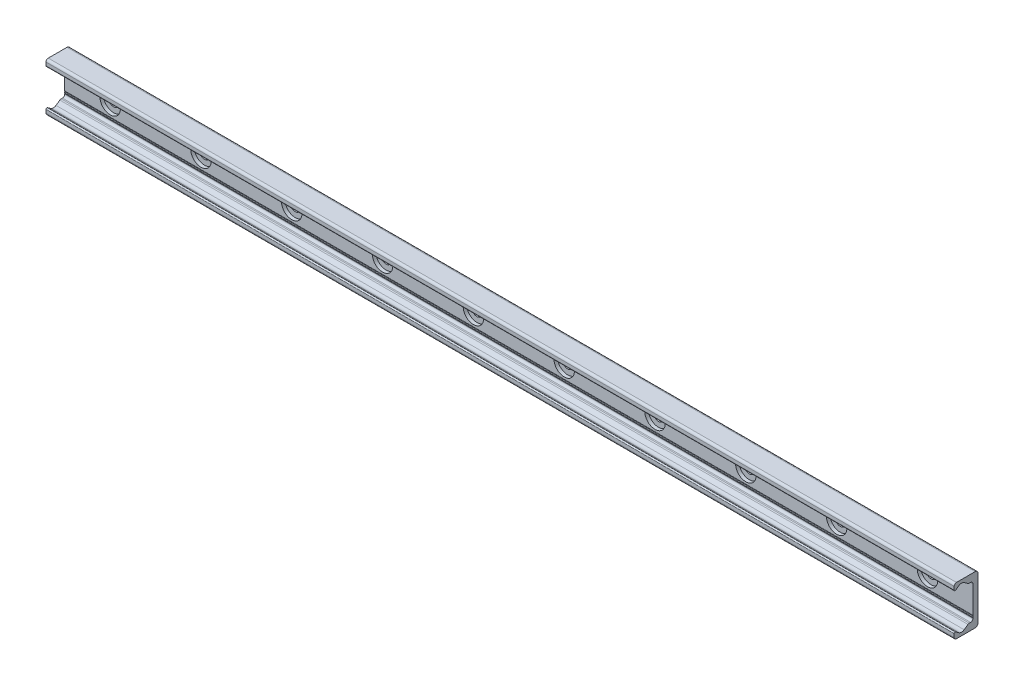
ISO-10303-21;
HEADER;
FILE_DESCRIPTION(('STEP AP214'),'2;1');
FILE_NAME('part.step','',(''),(''),'','','');
FILE_SCHEMA(('AUTOMOTIVE_DESIGN { 1 0 10303 214 1 1 1 1 }'));
ENDSEC;
DATA;
#1=APPLICATION_CONTEXT('core data for automotive mechanical design processes');
#2=APPLICATION_PROTOCOL_DEFINITION('international standard','automotive_design',2000,#1);
#3=PRODUCT_CONTEXT('',#1,'mechanical');
#4=PRODUCT('Part','Part','',(#3));
#5=PRODUCT_RELATED_PRODUCT_CATEGORY('part','',(#4));
#6=PRODUCT_DEFINITION_FORMATION('','',#4);
#7=PRODUCT_DEFINITION_CONTEXT('part definition',#1,'design');
#8=PRODUCT_DEFINITION('design','',#6,#7);
#9=PRODUCT_DEFINITION_SHAPE('','',#8);
#10=(LENGTH_UNIT() NAMED_UNIT(*) SI_UNIT(.MILLI.,.METRE.));
#11=(NAMED_UNIT(*) PLANE_ANGLE_UNIT() SI_UNIT($,.RADIAN.));
#12=(NAMED_UNIT(*) SI_UNIT($,.STERADIAN.) SOLID_ANGLE_UNIT());
#13=UNCERTAINTY_MEASURE_WITH_UNIT(LENGTH_MEASURE(1.E-05),#10,'distance_accuracy_value','');
#14=(GEOMETRIC_REPRESENTATION_CONTEXT(3) GLOBAL_UNCERTAINTY_ASSIGNED_CONTEXT((#13)) GLOBAL_UNIT_ASSIGNED_CONTEXT((#10,
#11,#12)) REPRESENTATION_CONTEXT('',''));
#15=CARTESIAN_POINT('',(0.,0.,0.));
#16=DIRECTION('',(0.,0.,1.));
#17=DIRECTION('',(1.,0.,0.));
#18=AXIS2_PLACEMENT_3D('',#15,#16,#17);
#19=CARTESIAN_POINT('',(-360.,0.,1.39999999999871));
#20=DIRECTION('',(0.,0.,1.));
#21=DIRECTION('',(1.,0.,0.));
#22=AXIS2_PLACEMENT_3D('',#19,#20,#21);
#23=PLANE('',#22);
#24=CARTESIAN_POINT('',(-360.,0.,1.39999999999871));
#25=DIRECTION('',(0.,0.,1.));
#26=DIRECTION('',(1.,0.,0.));
#27=AXIS2_PLACEMENT_3D('',#24,#25,#26);
#28=CIRCLE('',#27,4.50000000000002);
#29=CARTESIAN_POINT('',(-355.5,0.,1.39999999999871));
#30=VERTEX_POINT('',#29);
#31=EDGE_CURVE('E536',#30,#30,#28,.T.);
#32=ORIENTED_EDGE('',*,*,#31,.F.);
#33=EDGE_LOOP('',(#32));
#34=FACE_BOUND('',#33,.T.);
#35=CARTESIAN_POINT('',(-360.,0.,1.39999999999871));
#36=DIRECTION('',(0.,0.,1.));
#37=DIRECTION('',(1.,0.,0.));
#38=AXIS2_PLACEMENT_3D('',#35,#36,#37);
#39=CIRCLE('',#38,8.99999999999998);
#40=CARTESIAN_POINT('',(-351.,0.,1.39999999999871));
#41=VERTEX_POINT('',#40);
#42=EDGE_CURVE('E11',#41,#41,#39,.T.);
#43=ORIENTED_EDGE('',*,*,#42,.T.);
#44=EDGE_LOOP('',(#43));
#45=FACE_BOUND('',#44,.T.);
#46=ADVANCED_FACE('F39',(#34,#45),#23,.T.);
#47=CARTESIAN_POINT('',(-360.,0.,1.39999999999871));
#48=DIRECTION('',(0.,0.,1.));
#49=DIRECTION('',(1.,0.,0.));
#50=AXIS2_PLACEMENT_3D('',#47,#48,#49);
#51=CYLINDRICAL_SURFACE('',#50,8.99999999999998);
#52=CARTESIAN_POINT('',(-360.,0.,4.49999999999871));
#53=DIRECTION('',(0.,0.,1.));
#54=DIRECTION('',(1.,0.,0.));
#55=AXIS2_PLACEMENT_3D('',#52,#53,#54);
#56=CIRCLE('',#55,8.99999999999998);
#57=CARTESIAN_POINT('',(-351.,0.,4.49999999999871));
#58=VERTEX_POINT('',#57);
#59=EDGE_CURVE('E49',#58,#58,#56,.T.);
#60=CARTESIAN_POINT('',(-351.,0.,1.39999999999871));
#61=CARTESIAN_POINT('',(-351.,0.,1.43229166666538));
#62=CARTESIAN_POINT('',(-351.,0.,1.46458333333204));
#63=CARTESIAN_POINT('',(-351.,0.,1.52916666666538));
#64=CARTESIAN_POINT('',(-351.,0.,1.56145833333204));
#65=CARTESIAN_POINT('',(-351.,0.,1.62604166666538));
#66=CARTESIAN_POINT('',(-351.,0.,1.65833333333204));
#67=CARTESIAN_POINT('',(-351.,0.,1.72291666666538));
#68=CARTESIAN_POINT('',(-351.,0.,1.75520833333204));
#69=CARTESIAN_POINT('',(-351.,0.,1.81979166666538));
#70=CARTESIAN_POINT('',(-351.,0.,1.85208333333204));
#71=CARTESIAN_POINT('',(-351.,0.,1.91666666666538));
#72=CARTESIAN_POINT('',(-351.,0.,1.94895833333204));
#73=CARTESIAN_POINT('',(-351.,0.,2.01354166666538));
#74=CARTESIAN_POINT('',(-351.,0.,2.04583333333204));
#75=CARTESIAN_POINT('',(-351.,0.,2.11041666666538));
#76=CARTESIAN_POINT('',(-351.,0.,2.14270833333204));
#77=CARTESIAN_POINT('',(-351.,0.,2.20729166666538));
#78=CARTESIAN_POINT('',(-351.,0.,2.23958333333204));
#79=CARTESIAN_POINT('',(-351.,0.,2.30416666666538));
#80=CARTESIAN_POINT('',(-351.,0.,2.33645833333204));
#81=CARTESIAN_POINT('',(-351.,0.,2.40104166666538));
#82=CARTESIAN_POINT('',(-351.,0.,2.43333333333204));
#83=CARTESIAN_POINT('',(-351.,0.,2.49791666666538));
#84=CARTESIAN_POINT('',(-351.,0.,2.53020833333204));
#85=CARTESIAN_POINT('',(-351.,0.,2.59479166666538));
#86=CARTESIAN_POINT('',(-351.,0.,2.62708333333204));
#87=CARTESIAN_POINT('',(-351.,0.,2.69166666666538));
#88=CARTESIAN_POINT('',(-351.,0.,2.72395833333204));
#89=CARTESIAN_POINT('',(-351.,0.,2.78854166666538));
#90=CARTESIAN_POINT('',(-351.,0.,2.82083333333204));
#91=CARTESIAN_POINT('',(-351.,0.,2.88541666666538));
#92=CARTESIAN_POINT('',(-351.,0.,2.91770833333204));
#93=CARTESIAN_POINT('',(-351.,0.,2.98229166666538));
#94=CARTESIAN_POINT('',(-351.,0.,3.01458333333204));
#95=CARTESIAN_POINT('',(-351.,0.,3.07916666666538));
#96=CARTESIAN_POINT('',(-351.,0.,3.11145833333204));
#97=CARTESIAN_POINT('',(-351.,0.,3.17604166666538));
#98=CARTESIAN_POINT('',(-351.,0.,3.20833333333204));
#99=CARTESIAN_POINT('',(-351.,0.,3.27291666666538));
#100=CARTESIAN_POINT('',(-351.,0.,3.30520833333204));
#101=CARTESIAN_POINT('',(-351.,0.,3.36979166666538));
#102=CARTESIAN_POINT('',(-351.,0.,3.40208333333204));
#103=CARTESIAN_POINT('',(-351.,0.,3.46666666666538));
#104=CARTESIAN_POINT('',(-351.,0.,3.49895833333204));
#105=CARTESIAN_POINT('',(-351.,0.,3.56354166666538));
#106=CARTESIAN_POINT('',(-351.,0.,3.59583333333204));
#107=CARTESIAN_POINT('',(-351.,0.,3.66041666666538));
#108=CARTESIAN_POINT('',(-351.,0.,3.69270833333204));
#109=CARTESIAN_POINT('',(-351.,0.,3.75729166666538));
#110=CARTESIAN_POINT('',(-351.,0.,3.78958333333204));
#111=CARTESIAN_POINT('',(-351.,0.,3.85416666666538));
#112=CARTESIAN_POINT('',(-351.,0.,3.88645833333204));
#113=CARTESIAN_POINT('',(-351.,0.,3.95104166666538));
#114=CARTESIAN_POINT('',(-351.,0.,3.98333333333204));
#115=CARTESIAN_POINT('',(-351.,0.,4.04791666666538));
#116=CARTESIAN_POINT('',(-351.,0.,4.08020833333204));
#117=CARTESIAN_POINT('',(-351.,0.,4.14479166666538));
#118=CARTESIAN_POINT('',(-351.,0.,4.17708333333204));
#119=CARTESIAN_POINT('',(-351.,0.,4.24166666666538));
#120=CARTESIAN_POINT('',(-351.,0.,4.27395833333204));
#121=CARTESIAN_POINT('',(-351.,0.,4.33854166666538));
#122=CARTESIAN_POINT('',(-351.,0.,4.37083333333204));
#123=CARTESIAN_POINT('',(-351.,0.,4.43541666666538));
#124=CARTESIAN_POINT('',(-351.,0.,4.46770833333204));
#125=CARTESIAN_POINT('',(-351.,0.,4.49999999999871));
#126=B_SPLINE_CURVE_WITH_KNOTS('',3,(#60,#61,#62,#63,#64,#65,#66,#67,#68,#69,#70,#71,#72,#73,
#74,#75,#76,#77,#78,#79,#80,#81,#82,#83,#84,#85,#86,#87,#88,#89,#90,#91,#92,#93,#94,#95,#96,#97,
#98,#99,#100,#101,#102,#103,#104,#105,#106,#107,#108,#109,#110,#111,#112,#113,#114,#115,#116,
#117,#118,#119,#120,#121,#122,#123,#124,#125),.UNSPECIFIED.,.F.,.F.,(4,2,2,2,2,2,2,2,2,2,2,2,2,
2,2,2,2,2,2,2,2,2,2,2,2,2,2,2,2,2,2,2,4),(0.,0.0968750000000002,0.19375,0.290625,0.3875,
0.484375,0.58125,0.678125,0.775,0.871875,0.96875,1.065625,1.1625,1.259375,1.35625,1.453125,1.55,
1.646875,1.74375,1.840625,1.9375,2.034375,2.13125,2.228125,2.325,2.421875,2.51875,2.615625,
2.7125,2.809375,2.90625,3.003125,3.1),.UNSPECIFIED.);
#127=EDGE_CURVE('BSEAM506',#41,#58,#126,.T.);
#128=ORIENTED_EDGE('',*,*,#42,.F.);
#129=ORIENTED_EDGE('',*,*,#59,.T.);
#130=ORIENTED_EDGE('',*,*,#127,.T.);
#131=ORIENTED_EDGE('',*,*,#127,.F.);
#132=EDGE_LOOP('',(#128,#130,#129,#131));
#133=FACE_BOUND('',#132,.T.);
#134=ADVANCED_FACE('F506',(#133),#51,.F.);
#135=CARTESIAN_POINT('',(-280.,0.,1.39999999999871));
#136=DIRECTION('',(0.,0.,1.));
#137=DIRECTION('',(1.,0.,0.));
#138=AXIS2_PLACEMENT_3D('',#135,#136,#137);
#139=PLANE('',#138);
#140=CARTESIAN_POINT('',(-280.,0.,1.39999999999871));
#141=DIRECTION('',(0.,0.,1.));
#142=DIRECTION('',(1.,0.,0.));
#143=AXIS2_PLACEMENT_3D('',#140,#141,#142);
#144=CIRCLE('',#143,4.50000000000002);
#145=CARTESIAN_POINT('',(-275.5,0.,1.39999999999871));
#146=VERTEX_POINT('',#145);
#147=EDGE_CURVE('E540',#146,#146,#144,.T.);
#148=ORIENTED_EDGE('',*,*,#147,.F.);
#149=EDGE_LOOP('',(#148));
#150=FACE_BOUND('',#149,.T.);
#151=CARTESIAN_POINT('',(-280.,0.,1.39999999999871));
#152=DIRECTION('',(0.,0.,1.));
#153=DIRECTION('',(1.,0.,0.));
#154=AXIS2_PLACEMENT_3D('',#151,#152,#153);
#155=CIRCLE('',#154,8.99999999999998);
#156=CARTESIAN_POINT('',(-271.,0.,1.39999999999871));
#157=VERTEX_POINT('',#156);
#158=EDGE_CURVE('E498',#157,#157,#155,.T.);
#159=ORIENTED_EDGE('',*,*,#158,.T.);
#160=EDGE_LOOP('',(#159));
#161=FACE_BOUND('',#160,.T.);
#162=ADVANCED_FACE('F531',(#150,#161),#139,.T.);
#163=CARTESIAN_POINT('',(-280.,0.,1.39999999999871));
#164=DIRECTION('',(0.,0.,1.));
#165=DIRECTION('',(1.,0.,0.));
#166=AXIS2_PLACEMENT_3D('',#163,#164,#165);
#167=CYLINDRICAL_SURFACE('',#166,8.99999999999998);
#168=CARTESIAN_POINT('',(-280.,0.,4.49999999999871));
#169=DIRECTION('',(0.,0.,1.));
#170=DIRECTION('',(1.,0.,0.));
#171=AXIS2_PLACEMENT_3D('',#168,#169,#170);
#172=CIRCLE('',#171,8.99999999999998);
#173=CARTESIAN_POINT('',(-271.,0.,4.49999999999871));
#174=VERTEX_POINT('',#173);
#175=EDGE_CURVE('E494',#174,#174,#172,.T.);
#176=CARTESIAN_POINT('',(-271.,0.,1.39999999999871));
#177=CARTESIAN_POINT('',(-271.,0.,1.43229166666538));
#178=CARTESIAN_POINT('',(-271.,0.,1.46458333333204));
#179=CARTESIAN_POINT('',(-271.,0.,1.52916666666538));
#180=CARTESIAN_POINT('',(-271.,0.,1.56145833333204));
#181=CARTESIAN_POINT('',(-271.,0.,1.62604166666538));
#182=CARTESIAN_POINT('',(-271.,0.,1.65833333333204));
#183=CARTESIAN_POINT('',(-271.,0.,1.72291666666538));
#184=CARTESIAN_POINT('',(-271.,0.,1.75520833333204));
#185=CARTESIAN_POINT('',(-271.,0.,1.81979166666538));
#186=CARTESIAN_POINT('',(-271.,0.,1.85208333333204));
#187=CARTESIAN_POINT('',(-271.,0.,1.91666666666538));
#188=CARTESIAN_POINT('',(-271.,0.,1.94895833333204));
#189=CARTESIAN_POINT('',(-271.,0.,2.01354166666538));
#190=CARTESIAN_POINT('',(-271.,0.,2.04583333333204));
#191=CARTESIAN_POINT('',(-271.,0.,2.11041666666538));
#192=CARTESIAN_POINT('',(-271.,0.,2.14270833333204));
#193=CARTESIAN_POINT('',(-271.,0.,2.20729166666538));
#194=CARTESIAN_POINT('',(-271.,0.,2.23958333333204));
#195=CARTESIAN_POINT('',(-271.,0.,2.30416666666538));
#196=CARTESIAN_POINT('',(-271.,0.,2.33645833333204));
#197=CARTESIAN_POINT('',(-271.,0.,2.40104166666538));
#198=CARTESIAN_POINT('',(-271.,0.,2.43333333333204));
#199=CARTESIAN_POINT('',(-271.,0.,2.49791666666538));
#200=CARTESIAN_POINT('',(-271.,0.,2.53020833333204));
#201=CARTESIAN_POINT('',(-271.,0.,2.59479166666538));
#202=CARTESIAN_POINT('',(-271.,0.,2.62708333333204));
#203=CARTESIAN_POINT('',(-271.,0.,2.69166666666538));
#204=CARTESIAN_POINT('',(-271.,0.,2.72395833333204));
#205=CARTESIAN_POINT('',(-271.,0.,2.78854166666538));
#206=CARTESIAN_POINT('',(-271.,0.,2.82083333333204));
#207=CARTESIAN_POINT('',(-271.,0.,2.88541666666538));
#208=CARTESIAN_POINT('',(-271.,0.,2.91770833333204));
#209=CARTESIAN_POINT('',(-271.,0.,2.98229166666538));
#210=CARTESIAN_POINT('',(-271.,0.,3.01458333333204));
#211=CARTESIAN_POINT('',(-271.,0.,3.07916666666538));
#212=CARTESIAN_POINT('',(-271.,0.,3.11145833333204));
#213=CARTESIAN_POINT('',(-271.,0.,3.17604166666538));
#214=CARTESIAN_POINT('',(-271.,0.,3.20833333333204));
#215=CARTESIAN_POINT('',(-271.,0.,3.27291666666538));
#216=CARTESIAN_POINT('',(-271.,0.,3.30520833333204));
#217=CARTESIAN_POINT('',(-271.,0.,3.36979166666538));
#218=CARTESIAN_POINT('',(-271.,0.,3.40208333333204));
#219=CARTESIAN_POINT('',(-271.,0.,3.46666666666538));
#220=CARTESIAN_POINT('',(-271.,0.,3.49895833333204));
#221=CARTESIAN_POINT('',(-271.,0.,3.56354166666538));
#222=CARTESIAN_POINT('',(-271.,0.,3.59583333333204));
#223=CARTESIAN_POINT('',(-271.,0.,3.66041666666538));
#224=CARTESIAN_POINT('',(-271.,0.,3.69270833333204));
#225=CARTESIAN_POINT('',(-271.,0.,3.75729166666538));
#226=CARTESIAN_POINT('',(-271.,0.,3.78958333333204));
#227=CARTESIAN_POINT('',(-271.,0.,3.85416666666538));
#228=CARTESIAN_POINT('',(-271.,0.,3.88645833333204));
#229=CARTESIAN_POINT('',(-271.,0.,3.95104166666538));
#230=CARTESIAN_POINT('',(-271.,0.,3.98333333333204));
#231=CARTESIAN_POINT('',(-271.,0.,4.04791666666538));
#232=CARTESIAN_POINT('',(-271.,0.,4.08020833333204));
#233=CARTESIAN_POINT('',(-271.,0.,4.14479166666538));
#234=CARTESIAN_POINT('',(-271.,0.,4.17708333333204));
#235=CARTESIAN_POINT('',(-271.,0.,4.24166666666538));
#236=CARTESIAN_POINT('',(-271.,0.,4.27395833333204));
#237=CARTESIAN_POINT('',(-271.,0.,4.33854166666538));
#238=CARTESIAN_POINT('',(-271.,0.,4.37083333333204));
#239=CARTESIAN_POINT('',(-271.,0.,4.43541666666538));
#240=CARTESIAN_POINT('',(-271.,0.,4.46770833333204));
#241=CARTESIAN_POINT('',(-271.,0.,4.49999999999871));
#242=B_SPLINE_CURVE_WITH_KNOTS('',3,(#176,#177,#178,#179,#180,#181,#182,#183,#184,#185,#186,
#187,#188,#189,#190,#191,#192,#193,#194,#195,#196,#197,#198,#199,#200,#201,#202,#203,#204,#205,
#206,#207,#208,#209,#210,#211,#212,#213,#214,#215,#216,#217,#218,#219,#220,#221,#222,#223,#224,
#225,#226,#227,#228,#229,#230,#231,#232,#233,#234,#235,#236,#237,#238,#239,#240,#241),
.UNSPECIFIED.,.F.,.F.,(4,2,2,2,2,2,2,2,2,2,2,2,2,2,2,2,2,2,2,2,2,2,2,2,2,2,2,2,2,2,2,2,4),(0.,
0.0968750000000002,0.19375,0.290625,0.3875,0.484375,0.58125,0.678125,0.775,0.871875,0.96875,
1.065625,1.1625,1.259375,1.35625,1.453125,1.55,1.646875,1.74375,1.840625,1.9375,2.034375,
2.13125,2.228125,2.325,2.421875,2.51875,2.615625,2.7125,2.809375,2.90625,3.003125,3.1),.UNSPECIFIED.);
#243=EDGE_CURVE('BSEAM951',#157,#174,#242,.T.);
#244=ORIENTED_EDGE('',*,*,#158,.F.);
#245=ORIENTED_EDGE('',*,*,#175,.T.);
#246=ORIENTED_EDGE('',*,*,#243,.T.);
#247=ORIENTED_EDGE('',*,*,#243,.F.);
#248=EDGE_LOOP('',(#244,#246,#245,#247));
#249=FACE_BOUND('',#248,.T.);
#250=ADVANCED_FACE('F951',(#249),#167,.F.);
#251=CARTESIAN_POINT('',(-200.,0.,1.39999999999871));
#252=DIRECTION('',(0.,0.,1.));
#253=DIRECTION('',(1.,0.,0.));
#254=AXIS2_PLACEMENT_3D('',#251,#252,#253);
#255=PLANE('',#254);
#256=CARTESIAN_POINT('',(-200.,0.,1.39999999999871));
#257=DIRECTION('',(0.,0.,1.));
#258=DIRECTION('',(1.,0.,0.));
#259=AXIS2_PLACEMENT_3D('',#256,#257,#258);
#260=CIRCLE('',#259,4.50000000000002);
#261=CARTESIAN_POINT('',(-195.5,0.,1.39999999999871));
#262=VERTEX_POINT('',#261);
#263=EDGE_CURVE('E545',#262,#262,#260,.T.);
#264=ORIENTED_EDGE('',*,*,#263,.F.);
#265=EDGE_LOOP('',(#264));
#266=FACE_BOUND('',#265,.T.);
#267=CARTESIAN_POINT('',(-200.,0.,1.39999999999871));
#268=DIRECTION('',(0.,0.,1.));
#269=DIRECTION('',(1.,0.,0.));
#270=AXIS2_PLACEMENT_3D('',#267,#268,#269);
#271=CIRCLE('',#270,8.99999999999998);
#272=CARTESIAN_POINT('',(-191.,0.,1.39999999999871));
#273=VERTEX_POINT('',#272);
#274=EDGE_CURVE('E490',#273,#273,#271,.T.);
#275=ORIENTED_EDGE('',*,*,#274,.T.);
#276=EDGE_LOOP('',(#275));
#277=FACE_BOUND('',#276,.T.);
#278=ADVANCED_FACE('F947',(#266,#277),#255,.T.);
#279=CARTESIAN_POINT('',(-200.,0.,1.39999999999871));
#280=DIRECTION('',(0.,0.,1.));
#281=DIRECTION('',(1.,0.,0.));
#282=AXIS2_PLACEMENT_3D('',#279,#280,#281);
#283=CYLINDRICAL_SURFACE('',#282,8.99999999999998);
#284=CARTESIAN_POINT('',(-200.,0.,4.49999999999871));
#285=DIRECTION('',(0.,0.,1.));
#286=DIRECTION('',(1.,0.,0.));
#287=AXIS2_PLACEMENT_3D('',#284,#285,#286);
#288=CIRCLE('',#287,8.99999999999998);
#289=CARTESIAN_POINT('',(-191.,0.,4.49999999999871));
#290=VERTEX_POINT('',#289);
#291=EDGE_CURVE('E486',#290,#290,#288,.T.);
#292=CARTESIAN_POINT('',(-191.,0.,1.39999999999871));
#293=CARTESIAN_POINT('',(-191.,0.,1.43229166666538));
#294=CARTESIAN_POINT('',(-191.,0.,1.46458333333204));
#295=CARTESIAN_POINT('',(-191.,0.,1.52916666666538));
#296=CARTESIAN_POINT('',(-191.,0.,1.56145833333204));
#297=CARTESIAN_POINT('',(-191.,0.,1.62604166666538));
#298=CARTESIAN_POINT('',(-191.,0.,1.65833333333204));
#299=CARTESIAN_POINT('',(-191.,0.,1.72291666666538));
#300=CARTESIAN_POINT('',(-191.,0.,1.75520833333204));
#301=CARTESIAN_POINT('',(-191.,0.,1.81979166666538));
#302=CARTESIAN_POINT('',(-191.,0.,1.85208333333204));
#303=CARTESIAN_POINT('',(-191.,0.,1.91666666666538));
#304=CARTESIAN_POINT('',(-191.,0.,1.94895833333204));
#305=CARTESIAN_POINT('',(-191.,0.,2.01354166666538));
#306=CARTESIAN_POINT('',(-191.,0.,2.04583333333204));
#307=CARTESIAN_POINT('',(-191.,0.,2.11041666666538));
#308=CARTESIAN_POINT('',(-191.,0.,2.14270833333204));
#309=CARTESIAN_POINT('',(-191.,0.,2.20729166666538));
#310=CARTESIAN_POINT('',(-191.,0.,2.23958333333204));
#311=CARTESIAN_POINT('',(-191.,0.,2.30416666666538));
#312=CARTESIAN_POINT('',(-191.,0.,2.33645833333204));
#313=CARTESIAN_POINT('',(-191.,0.,2.40104166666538));
#314=CARTESIAN_POINT('',(-191.,0.,2.43333333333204));
#315=CARTESIAN_POINT('',(-191.,0.,2.49791666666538));
#316=CARTESIAN_POINT('',(-191.,0.,2.53020833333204));
#317=CARTESIAN_POINT('',(-191.,0.,2.59479166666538));
#318=CARTESIAN_POINT('',(-191.,0.,2.62708333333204));
#319=CARTESIAN_POINT('',(-191.,0.,2.69166666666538));
#320=CARTESIAN_POINT('',(-191.,0.,2.72395833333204));
#321=CARTESIAN_POINT('',(-191.,0.,2.78854166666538));
#322=CARTESIAN_POINT('',(-191.,0.,2.82083333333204));
#323=CARTESIAN_POINT('',(-191.,0.,2.88541666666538));
#324=CARTESIAN_POINT('',(-191.,0.,2.91770833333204));
#325=CARTESIAN_POINT('',(-191.,0.,2.98229166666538));
#326=CARTESIAN_POINT('',(-191.,0.,3.01458333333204));
#327=CARTESIAN_POINT('',(-191.,0.,3.07916666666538));
#328=CARTESIAN_POINT('',(-191.,0.,3.11145833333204));
#329=CARTESIAN_POINT('',(-191.,0.,3.17604166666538));
#330=CARTESIAN_POINT('',(-191.,0.,3.20833333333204));
#331=CARTESIAN_POINT('',(-191.,0.,3.27291666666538));
#332=CARTESIAN_POINT('',(-191.,0.,3.30520833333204));
#333=CARTESIAN_POINT('',(-191.,0.,3.36979166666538));
#334=CARTESIAN_POINT('',(-191.,0.,3.40208333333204));
#335=CARTESIAN_POINT('',(-191.,0.,3.46666666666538));
#336=CARTESIAN_POINT('',(-191.,0.,3.49895833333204));
#337=CARTESIAN_POINT('',(-191.,0.,3.56354166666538));
#338=CARTESIAN_POINT('',(-191.,0.,3.59583333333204));
#339=CARTESIAN_POINT('',(-191.,0.,3.66041666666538));
#340=CARTESIAN_POINT('',(-191.,0.,3.69270833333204));
#341=CARTESIAN_POINT('',(-191.,0.,3.75729166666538));
#342=CARTESIAN_POINT('',(-191.,0.,3.78958333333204));
#343=CARTESIAN_POINT('',(-191.,0.,3.85416666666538));
#344=CARTESIAN_POINT('',(-191.,0.,3.88645833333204));
#345=CARTESIAN_POINT('',(-191.,0.,3.95104166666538));
#346=CARTESIAN_POINT('',(-191.,0.,3.98333333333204));
#347=CARTESIAN_POINT('',(-191.,0.,4.04791666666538));
#348=CARTESIAN_POINT('',(-191.,0.,4.08020833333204));
#349=CARTESIAN_POINT('',(-191.,0.,4.14479166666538));
#350=CARTESIAN_POINT('',(-191.,0.,4.17708333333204));
#351=CARTESIAN_POINT('',(-191.,0.,4.24166666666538));
#352=CARTESIAN_POINT('',(-191.,0.,4.27395833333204));
#353=CARTESIAN_POINT('',(-191.,0.,4.33854166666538));
#354=CARTESIAN_POINT('',(-191.,0.,4.37083333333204));
#355=CARTESIAN_POINT('',(-191.,0.,4.43541666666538));
#356=CARTESIAN_POINT('',(-191.,0.,4.46770833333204));
#357=CARTESIAN_POINT('',(-191.,0.,4.49999999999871));
#358=B_SPLINE_CURVE_WITH_KNOTS('',3,(#292,#293,#294,#295,#296,#297,#298,#299,#300,#301,#302,
#303,#304,#305,#306,#307,#308,#309,#310,#311,#312,#313,#314,#315,#316,#317,#318,#319,#320,#321,
#322,#323,#324,#325,#326,#327,#328,#329,#330,#331,#332,#333,#334,#335,#336,#337,#338,#339,#340,
#341,#342,#343,#344,#345,#346,#347,#348,#349,#350,#351,#352,#353,#354,#355,#356,#357),
.UNSPECIFIED.,.F.,.F.,(4,2,2,2,2,2,2,2,2,2,2,2,2,2,2,2,2,2,2,2,2,2,2,2,2,2,2,2,2,2,2,2,4),(0.,
0.0968750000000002,0.19375,0.290625,0.3875,0.484375,0.58125,0.678125,0.775,0.871875,0.96875,
1.065625,1.1625,1.259375,1.35625,1.453125,1.55,1.646875,1.74375,1.840625,1.9375,2.034375,
2.13125,2.228125,2.325,2.421875,2.51875,2.615625,2.7125,2.809375,2.90625,3.003125,3.1),.UNSPECIFIED.);
#359=EDGE_CURVE('BSEAM943',#273,#290,#358,.T.);
#360=ORIENTED_EDGE('',*,*,#274,.F.);
#361=ORIENTED_EDGE('',*,*,#291,.T.);
#362=ORIENTED_EDGE('',*,*,#359,.T.);
#363=ORIENTED_EDGE('',*,*,#359,.F.);
#364=EDGE_LOOP('',(#360,#362,#361,#363));
#365=FACE_BOUND('',#364,.T.);
#366=ADVANCED_FACE('F943',(#365),#283,.F.);
#367=CARTESIAN_POINT('',(-120.,0.,1.39999999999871));
#368=DIRECTION('',(0.,0.,1.));
#369=DIRECTION('',(1.,0.,0.));
#370=AXIS2_PLACEMENT_3D('',#367,#368,#369);
#371=PLANE('',#370);
#372=CARTESIAN_POINT('',(-120.,0.,1.39999999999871));
#373=DIRECTION('',(0.,0.,1.));
#374=DIRECTION('',(1.,0.,0.));
#375=AXIS2_PLACEMENT_3D('',#372,#373,#374);
#376=CIRCLE('',#375,4.50000000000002);
#377=CARTESIAN_POINT('',(-115.5,0.,1.39999999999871));
#378=VERTEX_POINT('',#377);
#379=EDGE_CURVE('E557',#378,#378,#376,.T.);
#380=ORIENTED_EDGE('',*,*,#379,.F.);
#381=EDGE_LOOP('',(#380));
#382=FACE_BOUND('',#381,.T.);
#383=CARTESIAN_POINT('',(-120.,0.,1.39999999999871));
#384=DIRECTION('',(0.,0.,1.));
#385=DIRECTION('',(1.,0.,0.));
#386=AXIS2_PLACEMENT_3D('',#383,#384,#385);
#387=CIRCLE('',#386,8.99999999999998);
#388=CARTESIAN_POINT('',(-111.,0.,1.39999999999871));
#389=VERTEX_POINT('',#388);
#390=EDGE_CURVE('E482',#389,#389,#387,.T.);
#391=ORIENTED_EDGE('',*,*,#390,.T.);
#392=EDGE_LOOP('',(#391));
#393=FACE_BOUND('',#392,.T.);
#394=ADVANCED_FACE('F939',(#382,#393),#371,.T.);
#395=CARTESIAN_POINT('',(-120.,0.,1.39999999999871));
#396=DIRECTION('',(0.,0.,1.));
#397=DIRECTION('',(1.,0.,0.));
#398=AXIS2_PLACEMENT_3D('',#395,#396,#397);
#399=CYLINDRICAL_SURFACE('',#398,8.99999999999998);
#400=CARTESIAN_POINT('',(-120.,0.,4.49999999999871));
#401=DIRECTION('',(0.,0.,1.));
#402=DIRECTION('',(1.,0.,0.));
#403=AXIS2_PLACEMENT_3D('',#400,#401,#402);
#404=CIRCLE('',#403,8.99999999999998);
#405=CARTESIAN_POINT('',(-111.,0.,4.49999999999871));
#406=VERTEX_POINT('',#405);
#407=EDGE_CURVE('E478',#406,#406,#404,.T.);
#408=CARTESIAN_POINT('',(-111.,0.,1.39999999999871));
#409=CARTESIAN_POINT('',(-111.,0.,1.43229166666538));
#410=CARTESIAN_POINT('',(-111.,0.,1.46458333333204));
#411=CARTESIAN_POINT('',(-111.,0.,1.52916666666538));
#412=CARTESIAN_POINT('',(-111.,0.,1.56145833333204));
#413=CARTESIAN_POINT('',(-111.,0.,1.62604166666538));
#414=CARTESIAN_POINT('',(-111.,0.,1.65833333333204));
#415=CARTESIAN_POINT('',(-111.,0.,1.72291666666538));
#416=CARTESIAN_POINT('',(-111.,0.,1.75520833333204));
#417=CARTESIAN_POINT('',(-111.,0.,1.81979166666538));
#418=CARTESIAN_POINT('',(-111.,0.,1.85208333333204));
#419=CARTESIAN_POINT('',(-111.,0.,1.91666666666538));
#420=CARTESIAN_POINT('',(-111.,0.,1.94895833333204));
#421=CARTESIAN_POINT('',(-111.,0.,2.01354166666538));
#422=CARTESIAN_POINT('',(-111.,0.,2.04583333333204));
#423=CARTESIAN_POINT('',(-111.,0.,2.11041666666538));
#424=CARTESIAN_POINT('',(-111.,0.,2.14270833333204));
#425=CARTESIAN_POINT('',(-111.,0.,2.20729166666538));
#426=CARTESIAN_POINT('',(-111.,0.,2.23958333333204));
#427=CARTESIAN_POINT('',(-111.,0.,2.30416666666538));
#428=CARTESIAN_POINT('',(-111.,0.,2.33645833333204));
#429=CARTESIAN_POINT('',(-111.,0.,2.40104166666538));
#430=CARTESIAN_POINT('',(-111.,0.,2.43333333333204));
#431=CARTESIAN_POINT('',(-111.,0.,2.49791666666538));
#432=CARTESIAN_POINT('',(-111.,0.,2.53020833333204));
#433=CARTESIAN_POINT('',(-111.,0.,2.59479166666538));
#434=CARTESIAN_POINT('',(-111.,0.,2.62708333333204));
#435=CARTESIAN_POINT('',(-111.,0.,2.69166666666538));
#436=CARTESIAN_POINT('',(-111.,0.,2.72395833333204));
#437=CARTESIAN_POINT('',(-111.,0.,2.78854166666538));
#438=CARTESIAN_POINT('',(-111.,0.,2.82083333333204));
#439=CARTESIAN_POINT('',(-111.,0.,2.88541666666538));
#440=CARTESIAN_POINT('',(-111.,0.,2.91770833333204));
#441=CARTESIAN_POINT('',(-111.,0.,2.98229166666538));
#442=CARTESIAN_POINT('',(-111.,0.,3.01458333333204));
#443=CARTESIAN_POINT('',(-111.,0.,3.07916666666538));
#444=CARTESIAN_POINT('',(-111.,0.,3.11145833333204));
#445=CARTESIAN_POINT('',(-111.,0.,3.17604166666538));
#446=CARTESIAN_POINT('',(-111.,0.,3.20833333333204));
#447=CARTESIAN_POINT('',(-111.,0.,3.27291666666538));
#448=CARTESIAN_POINT('',(-111.,0.,3.30520833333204));
#449=CARTESIAN_POINT('',(-111.,0.,3.36979166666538));
#450=CARTESIAN_POINT('',(-111.,0.,3.40208333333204));
#451=CARTESIAN_POINT('',(-111.,0.,3.46666666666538));
#452=CARTESIAN_POINT('',(-111.,0.,3.49895833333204));
#453=CARTESIAN_POINT('',(-111.,0.,3.56354166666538));
#454=CARTESIAN_POINT('',(-111.,0.,3.59583333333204));
#455=CARTESIAN_POINT('',(-111.,0.,3.66041666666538));
#456=CARTESIAN_POINT('',(-111.,0.,3.69270833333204));
#457=CARTESIAN_POINT('',(-111.,0.,3.75729166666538));
#458=CARTESIAN_POINT('',(-111.,0.,3.78958333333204));
#459=CARTESIAN_POINT('',(-111.,0.,3.85416666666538));
#460=CARTESIAN_POINT('',(-111.,0.,3.88645833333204));
#461=CARTESIAN_POINT('',(-111.,0.,3.95104166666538));
#462=CARTESIAN_POINT('',(-111.,0.,3.98333333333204));
#463=CARTESIAN_POINT('',(-111.,0.,4.04791666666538));
#464=CARTESIAN_POINT('',(-111.,0.,4.08020833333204));
#465=CARTESIAN_POINT('',(-111.,0.,4.14479166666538));
#466=CARTESIAN_POINT('',(-111.,0.,4.17708333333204));
#467=CARTESIAN_POINT('',(-111.,0.,4.24166666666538));
#468=CARTESIAN_POINT('',(-111.,0.,4.27395833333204));
#469=CARTESIAN_POINT('',(-111.,0.,4.33854166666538));
#470=CARTESIAN_POINT('',(-111.,0.,4.37083333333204));
#471=CARTESIAN_POINT('',(-111.,0.,4.43541666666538));
#472=CARTESIAN_POINT('',(-111.,0.,4.46770833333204));
#473=CARTESIAN_POINT('',(-111.,0.,4.49999999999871));
#474=B_SPLINE_CURVE_WITH_KNOTS('',3,(#408,#409,#410,#411,#412,#413,#414,#415,#416,#417,#418,
#419,#420,#421,#422,#423,#424,#425,#426,#427,#428,#429,#430,#431,#432,#433,#434,#435,#436,#437,
#438,#439,#440,#441,#442,#443,#444,#445,#446,#447,#448,#449,#450,#451,#452,#453,#454,#455,#456,
#457,#458,#459,#460,#461,#462,#463,#464,#465,#466,#467,#468,#469,#470,#471,#472,#473),
.UNSPECIFIED.,.F.,.F.,(4,2,2,2,2,2,2,2,2,2,2,2,2,2,2,2,2,2,2,2,2,2,2,2,2,2,2,2,2,2,2,2,4),(0.,
0.0968750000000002,0.19375,0.290625,0.3875,0.484375,0.58125,0.678125,0.775,0.871875,0.96875,
1.065625,1.1625,1.259375,1.35625,1.453125,1.55,1.646875,1.74375,1.840625,1.9375,2.034375,
2.13125,2.228125,2.325,2.421875,2.51875,2.615625,2.7125,2.809375,2.90625,3.003125,3.1),.UNSPECIFIED.);
#475=EDGE_CURVE('BSEAM935',#389,#406,#474,.T.);
#476=ORIENTED_EDGE('',*,*,#390,.F.);
#477=ORIENTED_EDGE('',*,*,#407,.T.);
#478=ORIENTED_EDGE('',*,*,#475,.T.);
#479=ORIENTED_EDGE('',*,*,#475,.F.);
#480=EDGE_LOOP('',(#476,#478,#477,#479));
#481=FACE_BOUND('',#480,.T.);
#482=ADVANCED_FACE('F935',(#481),#399,.F.);
#483=CARTESIAN_POINT('',(-40.,0.,1.39999999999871));
#484=DIRECTION('',(0.,0.,1.));
#485=DIRECTION('',(1.,0.,0.));
#486=AXIS2_PLACEMENT_3D('',#483,#484,#485);
#487=PLANE('',#486);
#488=CARTESIAN_POINT('',(-40.,0.,1.39999999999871));
#489=DIRECTION('',(0.,0.,1.));
#490=DIRECTION('',(1.,0.,0.));
#491=AXIS2_PLACEMENT_3D('',#488,#489,#490);
#492=CIRCLE('',#491,4.50000000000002);
#493=CARTESIAN_POINT('',(-35.5,0.,1.39999999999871));
#494=VERTEX_POINT('',#493);
#495=EDGE_CURVE('E561',#494,#494,#492,.T.);
#496=ORIENTED_EDGE('',*,*,#495,.F.);
#497=EDGE_LOOP('',(#496));
#498=FACE_BOUND('',#497,.T.);
#499=CARTESIAN_POINT('',(-40.,0.,1.39999999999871));
#500=DIRECTION('',(0.,0.,1.));
#501=DIRECTION('',(1.,0.,0.));
#502=AXIS2_PLACEMENT_3D('',#499,#500,#501);
#503=CIRCLE('',#502,8.99999999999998);
#504=CARTESIAN_POINT('',(-31.,0.,1.39999999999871));
#505=VERTEX_POINT('',#504);
#506=EDGE_CURVE('E474',#505,#505,#503,.T.);
#507=ORIENTED_EDGE('',*,*,#506,.T.);
#508=EDGE_LOOP('',(#507));
#509=FACE_BOUND('',#508,.T.);
#510=ADVANCED_FACE('F931',(#498,#509),#487,.T.);
#511=CARTESIAN_POINT('',(-40.,0.,1.39999999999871));
#512=DIRECTION('',(0.,0.,1.));
#513=DIRECTION('',(1.,0.,0.));
#514=AXIS2_PLACEMENT_3D('',#511,#512,#513);
#515=CYLINDRICAL_SURFACE('',#514,8.99999999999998);
#516=CARTESIAN_POINT('',(-40.,0.,4.49999999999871));
#517=DIRECTION('',(0.,0.,1.));
#518=DIRECTION('',(1.,0.,0.));
#519=AXIS2_PLACEMENT_3D('',#516,#517,#518);
#520=CIRCLE('',#519,8.99999999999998);
#521=CARTESIAN_POINT('',(-31.,0.,4.49999999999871));
#522=VERTEX_POINT('',#521);
#523=EDGE_CURVE('E470',#522,#522,#520,.T.);
#524=CARTESIAN_POINT('',(-31.,0.,1.39999999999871));
#525=CARTESIAN_POINT('',(-31.,0.,1.43229166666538));
#526=CARTESIAN_POINT('',(-31.,0.,1.46458333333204));
#527=CARTESIAN_POINT('',(-31.,0.,1.52916666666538));
#528=CARTESIAN_POINT('',(-31.,0.,1.56145833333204));
#529=CARTESIAN_POINT('',(-31.,0.,1.62604166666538));
#530=CARTESIAN_POINT('',(-31.,0.,1.65833333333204));
#531=CARTESIAN_POINT('',(-31.,0.,1.72291666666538));
#532=CARTESIAN_POINT('',(-31.,0.,1.75520833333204));
#533=CARTESIAN_POINT('',(-31.,0.,1.81979166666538));
#534=CARTESIAN_POINT('',(-31.,0.,1.85208333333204));
#535=CARTESIAN_POINT('',(-31.,0.,1.91666666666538));
#536=CARTESIAN_POINT('',(-31.,0.,1.94895833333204));
#537=CARTESIAN_POINT('',(-31.,0.,2.01354166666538));
#538=CARTESIAN_POINT('',(-31.,0.,2.04583333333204));
#539=CARTESIAN_POINT('',(-31.,0.,2.11041666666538));
#540=CARTESIAN_POINT('',(-31.,0.,2.14270833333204));
#541=CARTESIAN_POINT('',(-31.,0.,2.20729166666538));
#542=CARTESIAN_POINT('',(-31.,0.,2.23958333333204));
#543=CARTESIAN_POINT('',(-31.,0.,2.30416666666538));
#544=CARTESIAN_POINT('',(-31.,0.,2.33645833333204));
#545=CARTESIAN_POINT('',(-31.,0.,2.40104166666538));
#546=CARTESIAN_POINT('',(-31.,0.,2.43333333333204));
#547=CARTESIAN_POINT('',(-31.,0.,2.49791666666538));
#548=CARTESIAN_POINT('',(-31.,0.,2.53020833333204));
#549=CARTESIAN_POINT('',(-31.,0.,2.59479166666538));
#550=CARTESIAN_POINT('',(-31.,0.,2.62708333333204));
#551=CARTESIAN_POINT('',(-31.,0.,2.69166666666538));
#552=CARTESIAN_POINT('',(-31.,0.,2.72395833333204));
#553=CARTESIAN_POINT('',(-31.,0.,2.78854166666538));
#554=CARTESIAN_POINT('',(-31.,0.,2.82083333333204));
#555=CARTESIAN_POINT('',(-31.,0.,2.88541666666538));
#556=CARTESIAN_POINT('',(-31.,0.,2.91770833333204));
#557=CARTESIAN_POINT('',(-31.,0.,2.98229166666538));
#558=CARTESIAN_POINT('',(-31.,0.,3.01458333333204));
#559=CARTESIAN_POINT('',(-31.,0.,3.07916666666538));
#560=CARTESIAN_POINT('',(-31.,0.,3.11145833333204));
#561=CARTESIAN_POINT('',(-31.,0.,3.17604166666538));
#562=CARTESIAN_POINT('',(-31.,0.,3.20833333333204));
#563=CARTESIAN_POINT('',(-31.,0.,3.27291666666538));
#564=CARTESIAN_POINT('',(-31.,0.,3.30520833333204));
#565=CARTESIAN_POINT('',(-31.,0.,3.36979166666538));
#566=CARTESIAN_POINT('',(-31.,0.,3.40208333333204));
#567=CARTESIAN_POINT('',(-31.,0.,3.46666666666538));
#568=CARTESIAN_POINT('',(-31.,0.,3.49895833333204));
#569=CARTESIAN_POINT('',(-31.,0.,3.56354166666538));
#570=CARTESIAN_POINT('',(-31.,0.,3.59583333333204));
#571=CARTESIAN_POINT('',(-31.,0.,3.66041666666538));
#572=CARTESIAN_POINT('',(-31.,0.,3.69270833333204));
#573=CARTESIAN_POINT('',(-31.,0.,3.75729166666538));
#574=CARTESIAN_POINT('',(-31.,0.,3.78958333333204));
#575=CARTESIAN_POINT('',(-31.,0.,3.85416666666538));
#576=CARTESIAN_POINT('',(-31.,0.,3.88645833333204));
#577=CARTESIAN_POINT('',(-31.,0.,3.95104166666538));
#578=CARTESIAN_POINT('',(-31.,0.,3.98333333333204));
#579=CARTESIAN_POINT('',(-31.,0.,4.04791666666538));
#580=CARTESIAN_POINT('',(-31.,0.,4.08020833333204));
#581=CARTESIAN_POINT('',(-31.,0.,4.14479166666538));
#582=CARTESIAN_POINT('',(-31.,0.,4.17708333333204));
#583=CARTESIAN_POINT('',(-31.,0.,4.24166666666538));
#584=CARTESIAN_POINT('',(-31.,0.,4.27395833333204));
#585=CARTESIAN_POINT('',(-31.,0.,4.33854166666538));
#586=CARTESIAN_POINT('',(-31.,0.,4.37083333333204));
#587=CARTESIAN_POINT('',(-31.,0.,4.43541666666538));
#588=CARTESIAN_POINT('',(-31.,0.,4.46770833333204));
#589=CARTESIAN_POINT('',(-31.,0.,4.49999999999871));
#590=B_SPLINE_CURVE_WITH_KNOTS('',3,(#524,#525,#526,#527,#528,#529,#530,#531,#532,#533,#534,
#535,#536,#537,#538,#539,#540,#541,#542,#543,#544,#545,#546,#547,#548,#549,#550,#551,#552,#553,
#554,#555,#556,#557,#558,#559,#560,#561,#562,#563,#564,#565,#566,#567,#568,#569,#570,#571,#572,
#573,#574,#575,#576,#577,#578,#579,#580,#581,#582,#583,#584,#585,#586,#587,#588,#589),
.UNSPECIFIED.,.F.,.F.,(4,2,2,2,2,2,2,2,2,2,2,2,2,2,2,2,2,2,2,2,2,2,2,2,2,2,2,2,2,2,2,2,4),(0.,
0.0968750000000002,0.19375,0.290625,0.3875,0.484375,0.58125,0.678125,0.775,0.871875,0.96875,
1.065625,1.1625,1.259375,1.35625,1.453125,1.55,1.646875,1.74375,1.840625,1.9375,2.034375,
2.13125,2.228125,2.325,2.421875,2.51875,2.615625,2.7125,2.809375,2.90625,3.003125,3.1),.UNSPECIFIED.);
#591=EDGE_CURVE('BSEAM927',#505,#522,#590,.T.);
#592=ORIENTED_EDGE('',*,*,#506,.F.);
#593=ORIENTED_EDGE('',*,*,#523,.T.);
#594=ORIENTED_EDGE('',*,*,#591,.T.);
#595=ORIENTED_EDGE('',*,*,#591,.F.);
#596=EDGE_LOOP('',(#592,#594,#593,#595));
#597=FACE_BOUND('',#596,.T.);
#598=ADVANCED_FACE('F927',(#597),#515,.F.);
#599=CARTESIAN_POINT('',(40.,0.,1.39999999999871));
#600=DIRECTION('',(0.,0.,1.));
#601=DIRECTION('',(1.,0.,0.));
#602=AXIS2_PLACEMENT_3D('',#599,#600,#601);
#603=PLANE('',#602);
#604=CARTESIAN_POINT('',(40.,0.,1.39999999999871));
#605=DIRECTION('',(0.,0.,1.));
#606=DIRECTION('',(1.,0.,0.));
#607=AXIS2_PLACEMENT_3D('',#604,#605,#606);
#608=CIRCLE('',#607,4.50000000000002);
#609=CARTESIAN_POINT('',(44.5000000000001,0.,1.39999999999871));
#610=VERTEX_POINT('',#609);
#611=EDGE_CURVE('E565',#610,#610,#608,.T.);
#612=ORIENTED_EDGE('',*,*,#611,.F.);
#613=EDGE_LOOP('',(#612));
#614=FACE_BOUND('',#613,.T.);
#615=CARTESIAN_POINT('',(40.,0.,1.39999999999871));
#616=DIRECTION('',(0.,0.,1.));
#617=DIRECTION('',(1.,0.,0.));
#618=AXIS2_PLACEMENT_3D('',#615,#616,#617);
#619=CIRCLE('',#618,8.99999999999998);
#620=CARTESIAN_POINT('',(49.,0.,1.39999999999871));
#621=VERTEX_POINT('',#620);
#622=EDGE_CURVE('E467',#621,#621,#619,.T.);
#623=ORIENTED_EDGE('',*,*,#622,.T.);
#624=EDGE_LOOP('',(#623));
#625=FACE_BOUND('',#624,.T.);
#626=ADVANCED_FACE('F923',(#614,#625),#603,.T.);
#627=CARTESIAN_POINT('',(40.,0.,1.39999999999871));
#628=DIRECTION('',(0.,0.,1.));
#629=DIRECTION('',(1.,0.,0.));
#630=AXIS2_PLACEMENT_3D('',#627,#628,#629);
#631=CYLINDRICAL_SURFACE('',#630,8.99999999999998);
#632=CARTESIAN_POINT('',(40.,0.,4.49999999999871));
#633=DIRECTION('',(0.,0.,1.));
#634=DIRECTION('',(1.,0.,0.));
#635=AXIS2_PLACEMENT_3D('',#632,#633,#634);
#636=CIRCLE('',#635,8.99999999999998);
#637=CARTESIAN_POINT('',(49.,0.,4.49999999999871));
#638=VERTEX_POINT('',#637);
#639=EDGE_CURVE('E463',#638,#638,#636,.T.);
#640=CARTESIAN_POINT('',(49.,0.,1.39999999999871));
#641=CARTESIAN_POINT('',(49.,0.,1.43229166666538));
#642=CARTESIAN_POINT('',(49.,0.,1.46458333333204));
#643=CARTESIAN_POINT('',(49.,0.,1.52916666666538));
#644=CARTESIAN_POINT('',(49.,0.,1.56145833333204));
#645=CARTESIAN_POINT('',(49.,0.,1.62604166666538));
#646=CARTESIAN_POINT('',(49.,0.,1.65833333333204));
#647=CARTESIAN_POINT('',(49.,0.,1.72291666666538));
#648=CARTESIAN_POINT('',(49.,0.,1.75520833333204));
#649=CARTESIAN_POINT('',(49.,0.,1.81979166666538));
#650=CARTESIAN_POINT('',(49.,0.,1.85208333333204));
#651=CARTESIAN_POINT('',(49.,0.,1.91666666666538));
#652=CARTESIAN_POINT('',(49.,0.,1.94895833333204));
#653=CARTESIAN_POINT('',(49.,0.,2.01354166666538));
#654=CARTESIAN_POINT('',(49.,0.,2.04583333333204));
#655=CARTESIAN_POINT('',(49.,0.,2.11041666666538));
#656=CARTESIAN_POINT('',(49.,0.,2.14270833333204));
#657=CARTESIAN_POINT('',(49.,0.,2.20729166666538));
#658=CARTESIAN_POINT('',(49.,0.,2.23958333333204));
#659=CARTESIAN_POINT('',(49.,0.,2.30416666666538));
#660=CARTESIAN_POINT('',(49.,0.,2.33645833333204));
#661=CARTESIAN_POINT('',(49.,0.,2.40104166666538));
#662=CARTESIAN_POINT('',(49.,0.,2.43333333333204));
#663=CARTESIAN_POINT('',(49.,0.,2.49791666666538));
#664=CARTESIAN_POINT('',(49.,0.,2.53020833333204));
#665=CARTESIAN_POINT('',(49.,0.,2.59479166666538));
#666=CARTESIAN_POINT('',(49.,0.,2.62708333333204));
#667=CARTESIAN_POINT('',(49.,0.,2.69166666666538));
#668=CARTESIAN_POINT('',(49.,0.,2.72395833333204));
#669=CARTESIAN_POINT('',(49.,0.,2.78854166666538));
#670=CARTESIAN_POINT('',(49.,0.,2.82083333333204));
#671=CARTESIAN_POINT('',(49.,0.,2.88541666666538));
#672=CARTESIAN_POINT('',(49.,0.,2.91770833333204));
#673=CARTESIAN_POINT('',(49.,0.,2.98229166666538));
#674=CARTESIAN_POINT('',(49.,0.,3.01458333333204));
#675=CARTESIAN_POINT('',(49.,0.,3.07916666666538));
#676=CARTESIAN_POINT('',(49.,0.,3.11145833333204));
#677=CARTESIAN_POINT('',(49.,0.,3.17604166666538));
#678=CARTESIAN_POINT('',(49.,0.,3.20833333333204));
#679=CARTESIAN_POINT('',(49.,0.,3.27291666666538));
#680=CARTESIAN_POINT('',(49.,0.,3.30520833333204));
#681=CARTESIAN_POINT('',(49.,0.,3.36979166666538));
#682=CARTESIAN_POINT('',(49.,0.,3.40208333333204));
#683=CARTESIAN_POINT('',(49.,0.,3.46666666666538));
#684=CARTESIAN_POINT('',(49.,0.,3.49895833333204));
#685=CARTESIAN_POINT('',(49.,0.,3.56354166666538));
#686=CARTESIAN_POINT('',(49.,0.,3.59583333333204));
#687=CARTESIAN_POINT('',(49.,0.,3.66041666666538));
#688=CARTESIAN_POINT('',(49.,0.,3.69270833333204));
#689=CARTESIAN_POINT('',(49.,0.,3.75729166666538));
#690=CARTESIAN_POINT('',(49.,0.,3.78958333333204));
#691=CARTESIAN_POINT('',(49.,0.,3.85416666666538));
#692=CARTESIAN_POINT('',(49.,0.,3.88645833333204));
#693=CARTESIAN_POINT('',(49.,0.,3.95104166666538));
#694=CARTESIAN_POINT('',(49.,0.,3.98333333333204));
#695=CARTESIAN_POINT('',(49.,0.,4.04791666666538));
#696=CARTESIAN_POINT('',(49.,0.,4.08020833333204));
#697=CARTESIAN_POINT('',(49.,0.,4.14479166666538));
#698=CARTESIAN_POINT('',(49.,0.,4.17708333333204));
#699=CARTESIAN_POINT('',(49.,0.,4.24166666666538));
#700=CARTESIAN_POINT('',(49.,0.,4.27395833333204));
#701=CARTESIAN_POINT('',(49.,0.,4.33854166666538));
#702=CARTESIAN_POINT('',(49.,0.,4.37083333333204));
#703=CARTESIAN_POINT('',(49.,0.,4.43541666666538));
#704=CARTESIAN_POINT('',(49.,0.,4.46770833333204));
#705=CARTESIAN_POINT('',(49.,0.,4.49999999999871));
#706=B_SPLINE_CURVE_WITH_KNOTS('',3,(#640,#641,#642,#643,#644,#645,#646,#647,#648,#649,#650,
#651,#652,#653,#654,#655,#656,#657,#658,#659,#660,#661,#662,#663,#664,#665,#666,#667,#668,#669,
#670,#671,#672,#673,#674,#675,#676,#677,#678,#679,#680,#681,#682,#683,#684,#685,#686,#687,#688,
#689,#690,#691,#692,#693,#694,#695,#696,#697,#698,#699,#700,#701,#702,#703,#704,#705),
.UNSPECIFIED.,.F.,.F.,(4,2,2,2,2,2,2,2,2,2,2,2,2,2,2,2,2,2,2,2,2,2,2,2,2,2,2,2,2,2,2,2,4),(0.,
0.0968750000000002,0.19375,0.290625,0.3875,0.484375,0.58125,0.678125,0.775,0.871875,0.96875,
1.065625,1.1625,1.259375,1.35625,1.453125,1.55,1.646875,1.74375,1.840625,1.9375,2.034375,
2.13125,2.228125,2.325,2.421875,2.51875,2.615625,2.7125,2.809375,2.90625,3.003125,3.1),.UNSPECIFIED.);
#707=EDGE_CURVE('BSEAM919',#621,#638,#706,.T.);
#708=ORIENTED_EDGE('',*,*,#622,.F.);
#709=ORIENTED_EDGE('',*,*,#639,.T.);
#710=ORIENTED_EDGE('',*,*,#707,.T.);
#711=ORIENTED_EDGE('',*,*,#707,.F.);
#712=EDGE_LOOP('',(#708,#710,#709,#711));
#713=FACE_BOUND('',#712,.T.);
#714=ADVANCED_FACE('F919',(#713),#631,.F.);
#715=CARTESIAN_POINT('',(120.,0.,1.39999999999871));
#716=DIRECTION('',(0.,0.,1.));
#717=DIRECTION('',(1.,0.,0.));
#718=AXIS2_PLACEMENT_3D('',#715,#716,#717);
#719=PLANE('',#718);
#720=CARTESIAN_POINT('',(120.,0.,1.39999999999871));
#721=DIRECTION('',(0.,0.,1.));
#722=DIRECTION('',(1.,0.,0.));
#723=AXIS2_PLACEMENT_3D('',#720,#721,#722);
#724=CIRCLE('',#723,4.50000000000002);
#725=CARTESIAN_POINT('',(124.5,0.,1.39999999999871));
#726=VERTEX_POINT('',#725);
#727=EDGE_CURVE('E569',#726,#726,#724,.T.);
#728=ORIENTED_EDGE('',*,*,#727,.F.);
#729=EDGE_LOOP('',(#728));
#730=FACE_BOUND('',#729,.T.);
#731=CARTESIAN_POINT('',(120.,0.,1.39999999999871));
#732=DIRECTION('',(0.,0.,1.));
#733=DIRECTION('',(1.,0.,0.));
#734=AXIS2_PLACEMENT_3D('',#731,#732,#733);
#735=CIRCLE('',#734,8.99999999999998);
#736=CARTESIAN_POINT('',(129.,0.,1.39999999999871));
#737=VERTEX_POINT('',#736);
#738=EDGE_CURVE('E459',#737,#737,#735,.T.);
#739=ORIENTED_EDGE('',*,*,#738,.T.);
#740=EDGE_LOOP('',(#739));
#741=FACE_BOUND('',#740,.T.);
#742=ADVANCED_FACE('F915',(#730,#741),#719,.T.);
#743=CARTESIAN_POINT('',(120.,0.,1.39999999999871));
#744=DIRECTION('',(0.,0.,1.));
#745=DIRECTION('',(1.,0.,0.));
#746=AXIS2_PLACEMENT_3D('',#743,#744,#745);
#747=CYLINDRICAL_SURFACE('',#746,8.99999999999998);
#748=CARTESIAN_POINT('',(120.,0.,4.49999999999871));
#749=DIRECTION('',(0.,0.,1.));
#750=DIRECTION('',(1.,0.,0.));
#751=AXIS2_PLACEMENT_3D('',#748,#749,#750);
#752=CIRCLE('',#751,8.99999999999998);
#753=CARTESIAN_POINT('',(129.,0.,4.49999999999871));
#754=VERTEX_POINT('',#753);
#755=EDGE_CURVE('E455',#754,#754,#752,.T.);
#756=CARTESIAN_POINT('',(129.,0.,1.39999999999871));
#757=CARTESIAN_POINT('',(129.,0.,1.43229166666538));
#758=CARTESIAN_POINT('',(129.,0.,1.46458333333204));
#759=CARTESIAN_POINT('',(129.,0.,1.52916666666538));
#760=CARTESIAN_POINT('',(129.,0.,1.56145833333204));
#761=CARTESIAN_POINT('',(129.,0.,1.62604166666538));
#762=CARTESIAN_POINT('',(129.,0.,1.65833333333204));
#763=CARTESIAN_POINT('',(129.,0.,1.72291666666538));
#764=CARTESIAN_POINT('',(129.,0.,1.75520833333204));
#765=CARTESIAN_POINT('',(129.,0.,1.81979166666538));
#766=CARTESIAN_POINT('',(129.,0.,1.85208333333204));
#767=CARTESIAN_POINT('',(129.,0.,1.91666666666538));
#768=CARTESIAN_POINT('',(129.,0.,1.94895833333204));
#769=CARTESIAN_POINT('',(129.,0.,2.01354166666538));
#770=CARTESIAN_POINT('',(129.,0.,2.04583333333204));
#771=CARTESIAN_POINT('',(129.,0.,2.11041666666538));
#772=CARTESIAN_POINT('',(129.,0.,2.14270833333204));
#773=CARTESIAN_POINT('',(129.,0.,2.20729166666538));
#774=CARTESIAN_POINT('',(129.,0.,2.23958333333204));
#775=CARTESIAN_POINT('',(129.,0.,2.30416666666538));
#776=CARTESIAN_POINT('',(129.,0.,2.33645833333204));
#777=CARTESIAN_POINT('',(129.,0.,2.40104166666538));
#778=CARTESIAN_POINT('',(129.,0.,2.43333333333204));
#779=CARTESIAN_POINT('',(129.,0.,2.49791666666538));
#780=CARTESIAN_POINT('',(129.,0.,2.53020833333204));
#781=CARTESIAN_POINT('',(129.,0.,2.59479166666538));
#782=CARTESIAN_POINT('',(129.,0.,2.62708333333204));
#783=CARTESIAN_POINT('',(129.,0.,2.69166666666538));
#784=CARTESIAN_POINT('',(129.,0.,2.72395833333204));
#785=CARTESIAN_POINT('',(129.,0.,2.78854166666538));
#786=CARTESIAN_POINT('',(129.,0.,2.82083333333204));
#787=CARTESIAN_POINT('',(129.,0.,2.88541666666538));
#788=CARTESIAN_POINT('',(129.,0.,2.91770833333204));
#789=CARTESIAN_POINT('',(129.,0.,2.98229166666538));
#790=CARTESIAN_POINT('',(129.,0.,3.01458333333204));
#791=CARTESIAN_POINT('',(129.,0.,3.07916666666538));
#792=CARTESIAN_POINT('',(129.,0.,3.11145833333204));
#793=CARTESIAN_POINT('',(129.,0.,3.17604166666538));
#794=CARTESIAN_POINT('',(129.,0.,3.20833333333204));
#795=CARTESIAN_POINT('',(129.,0.,3.27291666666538));
#796=CARTESIAN_POINT('',(129.,0.,3.30520833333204));
#797=CARTESIAN_POINT('',(129.,0.,3.36979166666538));
#798=CARTESIAN_POINT('',(129.,0.,3.40208333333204));
#799=CARTESIAN_POINT('',(129.,0.,3.46666666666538));
#800=CARTESIAN_POINT('',(129.,0.,3.49895833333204));
#801=CARTESIAN_POINT('',(129.,0.,3.56354166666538));
#802=CARTESIAN_POINT('',(129.,0.,3.59583333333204));
#803=CARTESIAN_POINT('',(129.,0.,3.66041666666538));
#804=CARTESIAN_POINT('',(129.,0.,3.69270833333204));
#805=CARTESIAN_POINT('',(129.,0.,3.75729166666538));
#806=CARTESIAN_POINT('',(129.,0.,3.78958333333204));
#807=CARTESIAN_POINT('',(129.,0.,3.85416666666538));
#808=CARTESIAN_POINT('',(129.,0.,3.88645833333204));
#809=CARTESIAN_POINT('',(129.,0.,3.95104166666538));
#810=CARTESIAN_POINT('',(129.,0.,3.98333333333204));
#811=CARTESIAN_POINT('',(129.,0.,4.04791666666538));
#812=CARTESIAN_POINT('',(129.,0.,4.08020833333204));
#813=CARTESIAN_POINT('',(129.,0.,4.14479166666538));
#814=CARTESIAN_POINT('',(129.,0.,4.17708333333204));
#815=CARTESIAN_POINT('',(129.,0.,4.24166666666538));
#816=CARTESIAN_POINT('',(129.,0.,4.27395833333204));
#817=CARTESIAN_POINT('',(129.,0.,4.33854166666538));
#818=CARTESIAN_POINT('',(129.,0.,4.37083333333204));
#819=CARTESIAN_POINT('',(129.,0.,4.43541666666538));
#820=CARTESIAN_POINT('',(129.,0.,4.46770833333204));
#821=CARTESIAN_POINT('',(129.,0.,4.49999999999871));
#822=B_SPLINE_CURVE_WITH_KNOTS('',3,(#756,#757,#758,#759,#760,#761,#762,#763,#764,#765,#766,
#767,#768,#769,#770,#771,#772,#773,#774,#775,#776,#777,#778,#779,#780,#781,#782,#783,#784,#785,
#786,#787,#788,#789,#790,#791,#792,#793,#794,#795,#796,#797,#798,#799,#800,#801,#802,#803,#804,
#805,#806,#807,#808,#809,#810,#811,#812,#813,#814,#815,#816,#817,#818,#819,#820,#821),
.UNSPECIFIED.,.F.,.F.,(4,2,2,2,2,2,2,2,2,2,2,2,2,2,2,2,2,2,2,2,2,2,2,2,2,2,2,2,2,2,2,2,4),(0.,
0.0968750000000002,0.19375,0.290625,0.3875,0.484375,0.58125,0.678125,0.775,0.871875,0.96875,
1.065625,1.1625,1.259375,1.35625,1.453125,1.55,1.646875,1.74375,1.840625,1.9375,2.034375,
2.13125,2.228125,2.325,2.421875,2.51875,2.615625,2.7125,2.809375,2.90625,3.003125,3.1),.UNSPECIFIED.);
#823=EDGE_CURVE('BSEAM911',#737,#754,#822,.T.);
#824=ORIENTED_EDGE('',*,*,#738,.F.);
#825=ORIENTED_EDGE('',*,*,#755,.T.);
#826=ORIENTED_EDGE('',*,*,#823,.T.);
#827=ORIENTED_EDGE('',*,*,#823,.F.);
#828=EDGE_LOOP('',(#824,#826,#825,#827));
#829=FACE_BOUND('',#828,.T.);
#830=ADVANCED_FACE('F911',(#829),#747,.F.);
#831=CARTESIAN_POINT('',(200.,0.,1.39999999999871));
#832=DIRECTION('',(0.,0.,1.));
#833=DIRECTION('',(1.,0.,0.));
#834=AXIS2_PLACEMENT_3D('',#831,#832,#833);
#835=PLANE('',#834);
#836=CARTESIAN_POINT('',(200.,0.,1.39999999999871));
#837=DIRECTION('',(0.,0.,1.));
#838=DIRECTION('',(1.,0.,0.));
#839=AXIS2_PLACEMENT_3D('',#836,#837,#838);
#840=CIRCLE('',#839,4.50000000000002);
#841=CARTESIAN_POINT('',(204.5,0.,1.39999999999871));
#842=VERTEX_POINT('',#841);
#843=EDGE_CURVE('E573',#842,#842,#840,.T.);
#844=ORIENTED_EDGE('',*,*,#843,.F.);
#845=EDGE_LOOP('',(#844));
#846=FACE_BOUND('',#845,.T.);
#847=CARTESIAN_POINT('',(200.,0.,1.39999999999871));
#848=DIRECTION('',(0.,0.,1.));
#849=DIRECTION('',(1.,0.,0.));
#850=AXIS2_PLACEMENT_3D('',#847,#848,#849);
#851=CIRCLE('',#850,8.99999999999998);
#852=CARTESIAN_POINT('',(209.,0.,1.39999999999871));
#853=VERTEX_POINT('',#852);
#854=EDGE_CURVE('E451',#853,#853,#851,.T.);
#855=ORIENTED_EDGE('',*,*,#854,.T.);
#856=EDGE_LOOP('',(#855));
#857=FACE_BOUND('',#856,.T.);
#858=ADVANCED_FACE('F904',(#846,#857),#835,.T.);
#859=CARTESIAN_POINT('',(200.,0.,1.39999999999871));
#860=DIRECTION('',(0.,0.,1.));
#861=DIRECTION('',(1.,0.,0.));
#862=AXIS2_PLACEMENT_3D('',#859,#860,#861);
#863=CYLINDRICAL_SURFACE('',#862,8.99999999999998);
#864=CARTESIAN_POINT('',(200.,0.,4.49999999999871));
#865=DIRECTION('',(0.,0.,1.));
#866=DIRECTION('',(1.,0.,0.));
#867=AXIS2_PLACEMENT_3D('',#864,#865,#866);
#868=CIRCLE('',#867,8.99999999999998);
#869=CARTESIAN_POINT('',(209.,0.,4.49999999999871));
#870=VERTEX_POINT('',#869);
#871=EDGE_CURVE('E447',#870,#870,#868,.T.);
#872=CARTESIAN_POINT('',(209.,0.,1.39999999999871));
#873=CARTESIAN_POINT('',(209.,0.,1.43229166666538));
#874=CARTESIAN_POINT('',(209.,0.,1.46458333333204));
#875=CARTESIAN_POINT('',(209.,0.,1.52916666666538));
#876=CARTESIAN_POINT('',(209.,0.,1.56145833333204));
#877=CARTESIAN_POINT('',(209.,0.,1.62604166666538));
#878=CARTESIAN_POINT('',(209.,0.,1.65833333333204));
#879=CARTESIAN_POINT('',(209.,0.,1.72291666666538));
#880=CARTESIAN_POINT('',(209.,0.,1.75520833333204));
#881=CARTESIAN_POINT('',(209.,0.,1.81979166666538));
#882=CARTESIAN_POINT('',(209.,0.,1.85208333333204));
#883=CARTESIAN_POINT('',(209.,0.,1.91666666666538));
#884=CARTESIAN_POINT('',(209.,0.,1.94895833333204));
#885=CARTESIAN_POINT('',(209.,0.,2.01354166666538));
#886=CARTESIAN_POINT('',(209.,0.,2.04583333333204));
#887=CARTESIAN_POINT('',(209.,0.,2.11041666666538));
#888=CARTESIAN_POINT('',(209.,0.,2.14270833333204));
#889=CARTESIAN_POINT('',(209.,0.,2.20729166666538));
#890=CARTESIAN_POINT('',(209.,0.,2.23958333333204));
#891=CARTESIAN_POINT('',(209.,0.,2.30416666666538));
#892=CARTESIAN_POINT('',(209.,0.,2.33645833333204));
#893=CARTESIAN_POINT('',(209.,0.,2.40104166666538));
#894=CARTESIAN_POINT('',(209.,0.,2.43333333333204));
#895=CARTESIAN_POINT('',(209.,0.,2.49791666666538));
#896=CARTESIAN_POINT('',(209.,0.,2.53020833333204));
#897=CARTESIAN_POINT('',(209.,0.,2.59479166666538));
#898=CARTESIAN_POINT('',(209.,0.,2.62708333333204));
#899=CARTESIAN_POINT('',(209.,0.,2.69166666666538));
#900=CARTESIAN_POINT('',(209.,0.,2.72395833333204));
#901=CARTESIAN_POINT('',(209.,0.,2.78854166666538));
#902=CARTESIAN_POINT('',(209.,0.,2.82083333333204));
#903=CARTESIAN_POINT('',(209.,0.,2.88541666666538));
#904=CARTESIAN_POINT('',(209.,0.,2.91770833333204));
#905=CARTESIAN_POINT('',(209.,0.,2.98229166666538));
#906=CARTESIAN_POINT('',(209.,0.,3.01458333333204));
#907=CARTESIAN_POINT('',(209.,0.,3.07916666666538));
#908=CARTESIAN_POINT('',(209.,0.,3.11145833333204));
#909=CARTESIAN_POINT('',(209.,0.,3.17604166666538));
#910=CARTESIAN_POINT('',(209.,0.,3.20833333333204));
#911=CARTESIAN_POINT('',(209.,0.,3.27291666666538));
#912=CARTESIAN_POINT('',(209.,0.,3.30520833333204));
#913=CARTESIAN_POINT('',(209.,0.,3.36979166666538));
#914=CARTESIAN_POINT('',(209.,0.,3.40208333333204));
#915=CARTESIAN_POINT('',(209.,0.,3.46666666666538));
#916=CARTESIAN_POINT('',(209.,0.,3.49895833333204));
#917=CARTESIAN_POINT('',(209.,0.,3.56354166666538));
#918=CARTESIAN_POINT('',(209.,0.,3.59583333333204));
#919=CARTESIAN_POINT('',(209.,0.,3.66041666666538));
#920=CARTESIAN_POINT('',(209.,0.,3.69270833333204));
#921=CARTESIAN_POINT('',(209.,0.,3.75729166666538));
#922=CARTESIAN_POINT('',(209.,0.,3.78958333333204));
#923=CARTESIAN_POINT('',(209.,0.,3.85416666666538));
#924=CARTESIAN_POINT('',(209.,0.,3.88645833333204));
#925=CARTESIAN_POINT('',(209.,0.,3.95104166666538));
#926=CARTESIAN_POINT('',(209.,0.,3.98333333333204));
#927=CARTESIAN_POINT('',(209.,0.,4.04791666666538));
#928=CARTESIAN_POINT('',(209.,0.,4.08020833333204));
#929=CARTESIAN_POINT('',(209.,0.,4.14479166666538));
#930=CARTESIAN_POINT('',(209.,0.,4.17708333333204));
#931=CARTESIAN_POINT('',(209.,0.,4.24166666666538));
#932=CARTESIAN_POINT('',(209.,0.,4.27395833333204));
#933=CARTESIAN_POINT('',(209.,0.,4.33854166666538));
#934=CARTESIAN_POINT('',(209.,0.,4.37083333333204));
#935=CARTESIAN_POINT('',(209.,0.,4.43541666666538));
#936=CARTESIAN_POINT('',(209.,0.,4.46770833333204));
#937=CARTESIAN_POINT('',(209.,0.,4.49999999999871));
#938=B_SPLINE_CURVE_WITH_KNOTS('',3,(#872,#873,#874,#875,#876,#877,#878,#879,#880,#881,#882,
#883,#884,#885,#886,#887,#888,#889,#890,#891,#892,#893,#894,#895,#896,#897,#898,#899,#900,#901,
#902,#903,#904,#905,#906,#907,#908,#909,#910,#911,#912,#913,#914,#915,#916,#917,#918,#919,#920,
#921,#922,#923,#924,#925,#926,#927,#928,#929,#930,#931,#932,#933,#934,#935,#936,#937),
.UNSPECIFIED.,.F.,.F.,(4,2,2,2,2,2,2,2,2,2,2,2,2,2,2,2,2,2,2,2,2,2,2,2,2,2,2,2,2,2,2,2,4),(0.,
0.0968750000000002,0.19375,0.290625,0.3875,0.484375,0.58125,0.678125,0.775,0.871875,0.96875,
1.065625,1.1625,1.259375,1.35625,1.453125,1.55,1.646875,1.74375,1.840625,1.9375,2.034375,
2.13125,2.228125,2.325,2.421875,2.51875,2.615625,2.7125,2.809375,2.90625,3.003125,3.1),.UNSPECIFIED.);
#939=EDGE_CURVE('BSEAM896',#853,#870,#938,.T.);
#940=ORIENTED_EDGE('',*,*,#854,.F.);
#941=ORIENTED_EDGE('',*,*,#871,.T.);
#942=ORIENTED_EDGE('',*,*,#939,.T.);
#943=ORIENTED_EDGE('',*,*,#939,.F.);
#944=EDGE_LOOP('',(#940,#942,#941,#943));
#945=FACE_BOUND('',#944,.T.);
#946=ADVANCED_FACE('F896',(#945),#863,.F.);
#947=CARTESIAN_POINT('',(400.,0.,0.));
#948=DIRECTION('',(0.,0.,1.));
#949=DIRECTION('',(1.,0.,0.));
#950=AXIS2_PLACEMENT_3D('',#947,#948,#949);
#951=PLANE('',#950);
#952=CARTESIAN_POINT('',(280.,0.,0.));
#953=DIRECTION('',(0.,0.,1.));
#954=DIRECTION('',(1.,0.,0.));
#955=AXIS2_PLACEMENT_3D('',#952,#953,#954);
#956=CIRCLE('',#955,4.50000000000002);
#957=CARTESIAN_POINT('',(284.5,0.,0.));
#958=VERTEX_POINT('',#957);
#959=EDGE_CURVE('E549',#958,#958,#956,.T.);
#960=ORIENTED_EDGE('',*,*,#959,.T.);
#961=EDGE_LOOP('',(#960));
#962=FACE_BOUND('',#961,.T.);
#963=CARTESIAN_POINT('',(200.,0.,0.));
#964=DIRECTION('',(0.,0.,1.));
#965=DIRECTION('',(1.,0.,0.));
#966=AXIS2_PLACEMENT_3D('',#963,#964,#965);
#967=CIRCLE('',#966,4.50000000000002);
#968=CARTESIAN_POINT('',(204.5,0.,0.));
#969=VERTEX_POINT('',#968);
#970=EDGE_CURVE('E671',#969,#969,#967,.T.);
#971=ORIENTED_EDGE('',*,*,#970,.T.);
#972=EDGE_LOOP('',(#971));
#973=FACE_BOUND('',#972,.T.);
#974=CARTESIAN_POINT('',(120.,0.,0.));
#975=DIRECTION('',(0.,0.,1.));
#976=DIRECTION('',(1.,0.,0.));
#977=AXIS2_PLACEMENT_3D('',#974,#975,#976);
#978=CIRCLE('',#977,4.50000000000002);
#979=CARTESIAN_POINT('',(124.5,0.,0.));
#980=VERTEX_POINT('',#979);
#981=EDGE_CURVE('E673',#980,#980,#978,.T.);
#982=ORIENTED_EDGE('',*,*,#981,.T.);
#983=EDGE_LOOP('',(#982));
#984=FACE_BOUND('',#983,.T.);
#985=CARTESIAN_POINT('',(40.,0.,0.));
#986=DIRECTION('',(0.,0.,1.));
#987=DIRECTION('',(1.,0.,0.));
#988=AXIS2_PLACEMENT_3D('',#985,#986,#987);
#989=CIRCLE('',#988,4.50000000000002);
#990=CARTESIAN_POINT('',(44.5000000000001,0.,0.));
#991=VERTEX_POINT('',#990);
#992=EDGE_CURVE('E682',#991,#991,#989,.T.);
#993=ORIENTED_EDGE('',*,*,#992,.T.);
#994=EDGE_LOOP('',(#993));
#995=FACE_BOUND('',#994,.T.);
#996=CARTESIAN_POINT('',(-40.,0.,0.));
#997=DIRECTION('',(0.,0.,1.));
#998=DIRECTION('',(1.,0.,0.));
#999=AXIS2_PLACEMENT_3D('',#996,#997,#998);
#1000=CIRCLE('',#999,4.50000000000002);
#1001=CARTESIAN_POINT('',(-35.5,0.,0.));
#1002=VERTEX_POINT('',#1001);
#1003=EDGE_CURVE('E688',#1002,#1002,#1000,.T.);
#1004=ORIENTED_EDGE('',*,*,#1003,.T.);
#1005=EDGE_LOOP('',(#1004));
#1006=FACE_BOUND('',#1005,.T.);
#1007=CARTESIAN_POINT('',(-120.,0.,0.));
#1008=DIRECTION('',(0.,0.,1.));
#1009=DIRECTION('',(1.,0.,0.));
#1010=AXIS2_PLACEMENT_3D('',#1007,#1008,#1009);
#1011=CIRCLE('',#1010,4.50000000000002);
#1012=CARTESIAN_POINT('',(-115.5,0.,0.));
#1013=VERTEX_POINT('',#1012);
#1014=EDGE_CURVE('E692',#1013,#1013,#1011,.T.);
#1015=ORIENTED_EDGE('',*,*,#1014,.T.);
#1016=EDGE_LOOP('',(#1015));
#1017=FACE_BOUND('',#1016,.T.);
#1018=CARTESIAN_POINT('',(-200.,0.,0.));
#1019=DIRECTION('',(0.,0.,1.));
#1020=DIRECTION('',(1.,0.,0.));
#1021=AXIS2_PLACEMENT_3D('',#1018,#1019,#1020);
#1022=CIRCLE('',#1021,4.50000000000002);
#1023=CARTESIAN_POINT('',(-195.5,0.,0.));
#1024=VERTEX_POINT('',#1023);
#1025=EDGE_CURVE('E696',#1024,#1024,#1022,.T.);
#1026=ORIENTED_EDGE('',*,*,#1025,.T.);
#1027=EDGE_LOOP('',(#1026));
#1028=FACE_BOUND('',#1027,.T.);
#1029=CARTESIAN_POINT('',(-280.,0.,0.));
#1030=DIRECTION('',(0.,0.,1.));
#1031=DIRECTION('',(1.,0.,0.));
#1032=AXIS2_PLACEMENT_3D('',#1029,#1030,#1031);
#1033=CIRCLE('',#1032,4.50000000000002);
#1034=CARTESIAN_POINT('',(-275.5,0.,0.));
#1035=VERTEX_POINT('',#1034);
#1036=EDGE_CURVE('E699',#1035,#1035,#1033,.T.);
#1037=ORIENTED_EDGE('',*,*,#1036,.T.);
#1038=EDGE_LOOP('',(#1037));
#1039=FACE_BOUND('',#1038,.T.);
#1040=CARTESIAN_POINT('',(-360.,0.,0.));
#1041=DIRECTION('',(0.,0.,1.));
#1042=DIRECTION('',(1.,0.,0.));
#1043=AXIS2_PLACEMENT_3D('',#1040,#1041,#1042);
#1044=CIRCLE('',#1043,4.50000000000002);
#1045=CARTESIAN_POINT('',(-355.5,0.,0.));
#1046=VERTEX_POINT('',#1045);
#1047=EDGE_CURVE('E551',#1046,#1046,#1044,.T.);
#1048=ORIENTED_EDGE('',*,*,#1047,.T.);
#1049=EDGE_LOOP('',(#1048));
#1050=FACE_BOUND('',#1049,.T.);
#1051=CARTESIAN_POINT('',(360.,0.,0.));
#1052=DIRECTION('',(0.,0.,1.));
#1053=DIRECTION('',(1.,0.,0.));
#1054=AXIS2_PLACEMENT_3D('',#1051,#1052,#1053);
#1055=CIRCLE('',#1054,4.50000000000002);
#1056=CARTESIAN_POINT('',(364.5,0.,0.));
#1057=VERTEX_POINT('',#1056);
#1058=EDGE_CURVE('E585',#1057,#1057,#1055,.T.);
#1059=ORIENTED_EDGE('',*,*,#1058,.T.);
#1060=EDGE_LOOP('',(#1059));
#1061=FACE_BOUND('',#1060,.T.);
#1062=DIRECTION('',(0.,1.,0.));
#1063=VECTOR('',#1062,1.);
#1064=CARTESIAN_POINT('',(-400.,0.,0.));
#1065=LINE('',#1064,#1063);
#1066=CARTESIAN_POINT('',(-400.,-19.,0.));
#1067=VERTEX_POINT('',#1066);
#1068=CARTESIAN_POINT('',(-400.,19.,0.));
#1069=VERTEX_POINT('',#1068);
#1070=EDGE_CURVE('E153',#1067,#1069,#1065,.T.);
#1071=ORIENTED_EDGE('',*,*,#1070,.T.);
#1072=DIRECTION('',(-1.,0.,0.));
#1073=VECTOR('',#1072,1.);
#1074=CARTESIAN_POINT('',(400.,19.,0.));
#1075=LINE('',#1074,#1073);
#1076=CARTESIAN_POINT('',(400.,19.,0.));
#1077=VERTEX_POINT('',#1076);
#1078=EDGE_CURVE('E443',#1077,#1069,#1075,.T.);
#1079=ORIENTED_EDGE('',*,*,#1078,.F.);
#1080=DIRECTION('',(0.,1.,0.));
#1081=VECTOR('',#1080,1.);
#1082=CARTESIAN_POINT('',(400.,0.,0.));
#1083=LINE('',#1082,#1081);
#1084=CARTESIAN_POINT('',(400.,-19.,0.));
#1085=VERTEX_POINT('',#1084);
#1086=EDGE_CURVE('E159',#1085,#1077,#1083,.T.);
#1087=ORIENTED_EDGE('',*,*,#1086,.F.);
#1088=DIRECTION('',(-1.,0.,0.));
#1089=VECTOR('',#1088,1.);
#1090=CARTESIAN_POINT('',(400.,-19.,0.));
#1091=LINE('',#1090,#1089);
#1092=EDGE_CURVE('E259',#1085,#1067,#1091,.T.);
#1093=ORIENTED_EDGE('',*,*,#1092,.T.);
#1094=EDGE_LOOP('',(#1071,#1079,#1087,#1093));
#1095=FACE_BOUND('',#1094,.T.);
#1096=ADVANCED_FACE('F708',(#962,#973,#984,#995,#1006,#1017,#1028,#1039,#1050,#1061,#1095),#951,.F.);
#1097=CARTESIAN_POINT('',(400.,19.,2.5));
#1098=DIRECTION('',(-1.,0.,0.));
#1099=DIRECTION('',(0.,0.,1.));
#1100=AXIS2_PLACEMENT_3D('',#1097,#1098,#1099);
#1101=CYLINDRICAL_SURFACE('',#1100,2.5);
#1102=CARTESIAN_POINT('',(-400.,19.,2.5));
#1103=DIRECTION('',(1.,0.,0.));
#1104=DIRECTION('',(0.,0.,-1.));
#1105=AXIS2_PLACEMENT_3D('',#1102,#1103,#1104);
#1106=CIRCLE('',#1105,2.5);
#1107=CARTESIAN_POINT('',(-400.,21.5,2.5));
#1108=VERTEX_POINT('',#1107);
#1109=EDGE_CURVE('E265',#1069,#1108,#1106,.T.);
#1110=ORIENTED_EDGE('',*,*,#1109,.T.);
#1111=DIRECTION('',(-1.,0.,0.));
#1112=VECTOR('',#1111,1.);
#1113=CARTESIAN_POINT('',(400.,21.5,2.5));
#1114=LINE('',#1113,#1112);
#1115=CARTESIAN_POINT('',(400.,21.5,2.5));
#1116=VERTEX_POINT('',#1115);
#1117=EDGE_CURVE('E439',#1116,#1108,#1114,.T.);
#1118=ORIENTED_EDGE('',*,*,#1117,.F.);
#1119=CARTESIAN_POINT('',(400.,19.,2.5));
#1120=DIRECTION('',(1.,0.,0.));
#1121=DIRECTION('',(0.,0.,-1.));
#1122=AXIS2_PLACEMENT_3D('',#1119,#1120,#1121);
#1123=CIRCLE('',#1122,2.5);
#1124=EDGE_CURVE('E601',#1077,#1116,#1123,.T.);
#1125=ORIENTED_EDGE('',*,*,#1124,.F.);
#1126=ORIENTED_EDGE('',*,*,#1078,.T.);
#1127=EDGE_LOOP('',(#1110,#1118,#1125,#1126));
#1128=FACE_BOUND('',#1127,.T.);
#1129=ADVANCED_FACE('F877',(#1128),#1101,.T.);
#1130=CARTESIAN_POINT('',(400.,21.5,2.5));
#1131=DIRECTION('',(0.,-1.,0.));
#1132=DIRECTION('',(0.,0.,-1.));
#1133=AXIS2_PLACEMENT_3D('',#1130,#1131,#1132);
#1134=PLANE('',#1133);
#1135=DIRECTION('',(0.,0.,1.));
#1136=VECTOR('',#1135,1.);
#1137=CARTESIAN_POINT('',(-400.,21.5,2.5));
#1138=LINE('',#1137,#1136);
#1139=CARTESIAN_POINT('',(-400.,21.5,19.000000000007));
#1140=VERTEX_POINT('',#1139);
#1141=EDGE_CURVE('E269',#1108,#1140,#1138,.T.);
#1142=ORIENTED_EDGE('',*,*,#1141,.T.);
#1143=DIRECTION('',(-1.,0.,0.));
#1144=VECTOR('',#1143,1.);
#1145=CARTESIAN_POINT('',(400.,21.5,19.000000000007));
#1146=LINE('',#1145,#1144);
#1147=CARTESIAN_POINT('',(400.,21.5,19.000000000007));
#1148=VERTEX_POINT('',#1147);
#1149=EDGE_CURVE('E435',#1148,#1140,#1146,.T.);
#1150=ORIENTED_EDGE('',*,*,#1149,.F.);
#1151=DIRECTION('',(0.,0.,1.));
#1152=VECTOR('',#1151,1.);
#1153=CARTESIAN_POINT('',(400.,21.5,2.5));
#1154=LINE('',#1153,#1152);
#1155=EDGE_CURVE('E604',#1116,#1148,#1154,.T.);
#1156=ORIENTED_EDGE('',*,*,#1155,.F.);
#1157=ORIENTED_EDGE('',*,*,#1117,.T.);
#1158=EDGE_LOOP('',(#1142,#1150,#1156,#1157));
#1159=FACE_BOUND('',#1158,.T.);
#1160=ADVANCED_FACE('F873',(#1159),#1134,.F.);
#1161=CARTESIAN_POINT('',(400.,19.4999999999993,19.000000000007));
#1162=DIRECTION('',(-1.,0.,0.));
#1163=DIRECTION('',(0.,0.,1.));
#1164=AXIS2_PLACEMENT_3D('',#1161,#1162,#1163);
#1165=CYLINDRICAL_SURFACE('',#1164,2.00000000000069);
#1166=CARTESIAN_POINT('',(-400.,19.4999999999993,19.000000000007));
#1167=DIRECTION('',(1.,0.,0.));
#1168=DIRECTION('',(0.,0.,-1.));
#1169=AXIS2_PLACEMENT_3D('',#1166,#1167,#1168);
#1170=CIRCLE('',#1169,2.00000000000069);
#1171=CARTESIAN_POINT('',(-400.,19.4999999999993,21.0000000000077));
#1172=VERTEX_POINT('',#1171);
#1173=EDGE_CURVE('E272',#1140,#1172,#1170,.T.);
#1174=ORIENTED_EDGE('',*,*,#1173,.T.);
#1175=DIRECTION('',(-1.,0.,0.));
#1176=VECTOR('',#1175,1.);
#1177=CARTESIAN_POINT('',(400.,19.4999999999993,21.0000000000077));
#1178=LINE('',#1177,#1176);
#1179=CARTESIAN_POINT('',(400.,19.4999999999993,21.0000000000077));
#1180=VERTEX_POINT('',#1179);
#1181=EDGE_CURVE('E431',#1180,#1172,#1178,.T.);
#1182=ORIENTED_EDGE('',*,*,#1181,.F.);
#1183=CARTESIAN_POINT('',(400.,19.4999999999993,19.000000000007));
#1184=DIRECTION('',(1.,0.,0.));
#1185=DIRECTION('',(0.,0.,-1.));
#1186=AXIS2_PLACEMENT_3D('',#1183,#1184,#1185);
#1187=CIRCLE('',#1186,2.00000000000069);
#1188=EDGE_CURVE('E607',#1148,#1180,#1187,.T.);
#1189=ORIENTED_EDGE('',*,*,#1188,.F.);
#1190=ORIENTED_EDGE('',*,*,#1149,.T.);
#1191=EDGE_LOOP('',(#1174,#1182,#1189,#1190));
#1192=FACE_BOUND('',#1191,.T.);
#1193=ADVANCED_FACE('F868',(#1192),#1165,.T.);
#1194=CARTESIAN_POINT('',(400.,19.4999999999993,21.0000000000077));
#1195=DIRECTION('',(0.,0.,-1.));
#1196=DIRECTION('',(-1.,0.,0.));
#1197=AXIS2_PLACEMENT_3D('',#1194,#1195,#1196);
#1198=PLANE('',#1197);
#1199=DIRECTION('',(0.,-1.,0.));
#1200=VECTOR('',#1199,1.);
#1201=CARTESIAN_POINT('',(-400.,19.4999999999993,21.0000000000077));
#1202=LINE('',#1201,#1200);
#1203=CARTESIAN_POINT('',(-400.,16.6250570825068,21.0000000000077));
#1204=VERTEX_POINT('',#1203);
#1205=EDGE_CURVE('E275',#1172,#1204,#1202,.T.);
#1206=ORIENTED_EDGE('',*,*,#1205,.T.);
#1207=DIRECTION('',(-1.,0.,0.));
#1208=VECTOR('',#1207,1.);
#1209=CARTESIAN_POINT('',(400.,16.6250570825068,21.0000000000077));
#1210=LINE('',#1209,#1208);
#1211=CARTESIAN_POINT('',(400.,16.6250570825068,21.0000000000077));
#1212=VERTEX_POINT('',#1211);
#1213=EDGE_CURVE('E427',#1212,#1204,#1210,.T.);
#1214=ORIENTED_EDGE('',*,*,#1213,.F.);
#1215=DIRECTION('',(0.,-1.,0.));
#1216=VECTOR('',#1215,1.);
#1217=CARTESIAN_POINT('',(400.,19.4999999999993,21.0000000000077));
#1218=LINE('',#1217,#1216);
#1219=EDGE_CURVE('E610',#1180,#1212,#1218,.T.);
#1220=ORIENTED_EDGE('',*,*,#1219,.F.);
#1221=ORIENTED_EDGE('',*,*,#1181,.T.);
#1222=EDGE_LOOP('',(#1206,#1214,#1220,#1221));
#1223=FACE_BOUND('',#1222,.T.);
#1224=ADVANCED_FACE('F863',(#1223),#1198,.F.);
#1225=CARTESIAN_POINT('',(400.,16.6250570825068,20.1700000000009));
#1226=DIRECTION('',(-1.,0.,0.));
#1227=DIRECTION('',(0.,0.,1.));
#1228=AXIS2_PLACEMENT_3D('',#1225,#1226,#1227);
#1229=CYLINDRICAL_SURFACE('',#1228,0.83000000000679);
#1230=CARTESIAN_POINT('',(-400.,16.6250570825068,20.1700000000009));
#1231=DIRECTION('',(1.,0.,0.));
#1232=DIRECTION('',(0.,0.,-1.));
#1233=AXIS2_PLACEMENT_3D('',#1230,#1231,#1232);
#1234=CIRCLE('',#1233,0.83000000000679);
#1235=CARTESIAN_POINT('',(-400.,15.9451608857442,19.6939315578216));
#1236=VERTEX_POINT('',#1235);
#1237=EDGE_CURVE('E278',#1204,#1236,#1234,.T.);
#1238=ORIENTED_EDGE('',*,*,#1237,.T.);
#1239=DIRECTION('',(-1.,0.,0.));
#1240=VECTOR('',#1239,1.);
#1241=CARTESIAN_POINT('',(400.,15.9451608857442,19.6939315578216));
#1242=LINE('',#1241,#1240);
#1243=CARTESIAN_POINT('',(400.,15.9451608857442,19.6939315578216));
#1244=VERTEX_POINT('',#1243);
#1245=EDGE_CURVE('E423',#1244,#1236,#1242,.T.);
#1246=ORIENTED_EDGE('',*,*,#1245,.F.);
#1247=CARTESIAN_POINT('',(400.,16.6250570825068,20.1700000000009));
#1248=DIRECTION('',(1.,0.,0.));
#1249=DIRECTION('',(0.,0.,-1.));
#1250=AXIS2_PLACEMENT_3D('',#1247,#1248,#1249);
#1251=CIRCLE('',#1250,0.83000000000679);
#1252=EDGE_CURVE('E613',#1212,#1244,#1251,.T.);
#1253=ORIENTED_EDGE('',*,*,#1252,.F.);
#1254=ORIENTED_EDGE('',*,*,#1213,.T.);
#1255=EDGE_LOOP('',(#1238,#1246,#1253,#1254));
#1256=FACE_BOUND('',#1255,.T.);
#1257=ADVANCED_FACE('F859',(#1256),#1229,.T.);
#1258=CARTESIAN_POINT('',(400.,15.9451608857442,19.6939315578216));
#1259=DIRECTION('',(0.,0.81915204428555,0.573576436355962));
#1260=DIRECTION('',(0.,-0.573576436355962,0.81915204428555));
#1261=AXIS2_PLACEMENT_3D('',#1258,#1259,#1260);
#1262=PLANE('',#1261);
#1263=DIRECTION('',(0.,0.573576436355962,-0.81915204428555));
#1264=VECTOR('',#1263,1.);
#1265=CARTESIAN_POINT('',(-400.,15.9451608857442,19.6939315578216));
#1266=LINE('',#1265,#1264);
#1267=CARTESIAN_POINT('',(-400.,17.975500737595,16.7943057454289));
#1268=VERTEX_POINT('',#1267);
#1269=EDGE_CURVE('E281',#1236,#1268,#1266,.T.);
#1270=ORIENTED_EDGE('',*,*,#1269,.T.);
#1271=DIRECTION('',(-1.,0.,0.));
#1272=VECTOR('',#1271,1.);
#1273=CARTESIAN_POINT('',(400.,17.975500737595,16.7943057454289));
#1274=LINE('',#1273,#1272);
#1275=CARTESIAN_POINT('',(400.,17.975500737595,16.7943057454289));
#1276=VERTEX_POINT('',#1275);
#1277=EDGE_CURVE('E419',#1276,#1268,#1274,.T.);
#1278=ORIENTED_EDGE('',*,*,#1277,.F.);
#1279=DIRECTION('',(0.,0.573576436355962,-0.81915204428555));
#1280=VECTOR('',#1279,1.);
#1281=CARTESIAN_POINT('',(400.,15.9451608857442,19.6939315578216));
#1282=LINE('',#1281,#1280);
#1283=EDGE_CURVE('E616',#1244,#1276,#1282,.T.);
#1284=ORIENTED_EDGE('',*,*,#1283,.F.);
#1285=ORIENTED_EDGE('',*,*,#1245,.T.);
#1286=EDGE_LOOP('',(#1270,#1278,#1284,#1285));
#1287=FACE_BOUND('',#1286,.T.);
#1288=ADVANCED_FACE('F854',(#1287),#1262,.F.);
#1289=CARTESIAN_POINT('',(400.,14.6988925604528,14.5000000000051));
#1290=DIRECTION('',(-1.,0.,0.));
#1291=DIRECTION('',(0.,0.,1.));
#1292=AXIS2_PLACEMENT_3D('',#1289,#1290,#1291);
#1293=CYLINDRICAL_SURFACE('',#1292,3.99999999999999);
#1294=CARTESIAN_POINT('',(-400.,14.6988925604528,14.5000000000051));
#1295=DIRECTION('',(-1.,0.,0.));
#1296=DIRECTION('',(0.,0.,1.));
#1297=AXIS2_PLACEMENT_3D('',#1294,#1295,#1296);
#1298=CIRCLE('',#1297,3.99999999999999);
#1299=CARTESIAN_POINT('',(-400.,17.975500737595,12.2056942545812));
#1300=VERTEX_POINT('',#1299);
#1301=EDGE_CURVE('E284',#1268,#1300,#1298,.T.);
#1302=ORIENTED_EDGE('',*,*,#1301,.T.);
#1303=DIRECTION('',(-1.,0.,0.));
#1304=VECTOR('',#1303,1.);
#1305=CARTESIAN_POINT('',(400.,17.975500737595,12.2056942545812));
#1306=LINE('',#1305,#1304);
#1307=CARTESIAN_POINT('',(400.,17.975500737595,12.2056942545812));
#1308=VERTEX_POINT('',#1307);
#1309=EDGE_CURVE('E415',#1308,#1300,#1306,.T.);
#1310=ORIENTED_EDGE('',*,*,#1309,.F.);
#1311=CARTESIAN_POINT('',(400.,14.6988925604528,14.5000000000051));
#1312=DIRECTION('',(-1.,0.,0.));
#1313=DIRECTION('',(0.,0.,1.));
#1314=AXIS2_PLACEMENT_3D('',#1311,#1312,#1313);
#1315=CIRCLE('',#1314,3.99999999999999);
#1316=EDGE_CURVE('E619',#1276,#1308,#1315,.T.);
#1317=ORIENTED_EDGE('',*,*,#1316,.F.);
#1318=ORIENTED_EDGE('',*,*,#1277,.T.);
#1319=EDGE_LOOP('',(#1302,#1310,#1317,#1318));
#1320=FACE_BOUND('',#1319,.T.);
#1321=ADVANCED_FACE('F848',(#1320),#1293,.F.);
#1322=CARTESIAN_POINT('',(400.,17.975500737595,12.2056942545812));
#1323=DIRECTION('',(0.,0.81915204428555,-0.573576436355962));
#1324=DIRECTION('',(0.,0.573576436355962,0.81915204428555));
#1325=AXIS2_PLACEMENT_3D('',#1322,#1323,#1324);
#1326=PLANE('',#1325);
#1327=DIRECTION('',(0.,-0.573576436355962,-0.81915204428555));
#1328=VECTOR('',#1327,1.);
#1329=CARTESIAN_POINT('',(-400.,17.975500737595,12.2056942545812));
#1330=LINE('',#1329,#1328);
#1331=CARTESIAN_POINT('',(-400.,15.6116959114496,8.82983110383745));
#1332=VERTEX_POINT('',#1331);
#1333=EDGE_CURVE('E287',#1300,#1332,#1330,.T.);
#1334=ORIENTED_EDGE('',*,*,#1333,.T.);
#1335=DIRECTION('',(-1.,0.,0.));
#1336=VECTOR('',#1335,1.);
#1337=CARTESIAN_POINT('',(400.,15.6116959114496,8.82983110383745));
#1338=LINE('',#1337,#1336);
#1339=CARTESIAN_POINT('',(400.,15.6116959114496,8.82983110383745));
#1340=VERTEX_POINT('',#1339);
#1341=EDGE_CURVE('E411',#1340,#1332,#1338,.T.);
#1342=ORIENTED_EDGE('',*,*,#1341,.F.);
#1343=DIRECTION('',(0.,-0.573576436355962,-0.81915204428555));
#1344=VECTOR('',#1343,1.);
#1345=CARTESIAN_POINT('',(400.,17.975500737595,12.2056942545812));
#1346=LINE('',#1345,#1344);
#1347=EDGE_CURVE('E622',#1308,#1340,#1346,.T.);
#1348=ORIENTED_EDGE('',*,*,#1347,.F.);
#1349=ORIENTED_EDGE('',*,*,#1309,.T.);
#1350=EDGE_LOOP('',(#1334,#1342,#1348,#1349));
#1351=FACE_BOUND('',#1350,.T.);
#1352=ADVANCED_FACE('F844',(#1351),#1326,.F.);
#1353=CARTESIAN_POINT('',(400.,17.2500000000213,7.68267823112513));
#1354=DIRECTION('',(-1.,0.,0.));
#1355=DIRECTION('',(0.,0.,1.));
#1356=AXIS2_PLACEMENT_3D('',#1353,#1354,#1355);
#1357=CYLINDRICAL_SURFACE('',#1356,2.00000000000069);
#1358=CARTESIAN_POINT('',(-400.,17.2500000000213,7.68267823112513));
#1359=DIRECTION('',(1.,0.,0.));
#1360=DIRECTION('',(0.,0.,-1.));
#1361=AXIS2_PLACEMENT_3D('',#1358,#1359,#1360);
#1362=CIRCLE('',#1361,2.00000000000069);
#1363=CARTESIAN_POINT('',(-400.,15.2500000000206,7.68267823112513));
#1364=VERTEX_POINT('',#1363);
#1365=EDGE_CURVE('E290',#1332,#1364,#1362,.T.);
#1366=ORIENTED_EDGE('',*,*,#1365,.T.);
#1367=DIRECTION('',(-1.,0.,0.));
#1368=VECTOR('',#1367,1.);
#1369=CARTESIAN_POINT('',(400.,15.2500000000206,7.68267823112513));
#1370=LINE('',#1369,#1368);
#1371=CARTESIAN_POINT('',(400.,15.2500000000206,7.68267823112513));
#1372=VERTEX_POINT('',#1371);
#1373=EDGE_CURVE('E407',#1372,#1364,#1370,.T.);
#1374=ORIENTED_EDGE('',*,*,#1373,.F.);
#1375=CARTESIAN_POINT('',(400.,17.2500000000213,7.68267823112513));
#1376=DIRECTION('',(1.,0.,0.));
#1377=DIRECTION('',(0.,0.,-1.));
#1378=AXIS2_PLACEMENT_3D('',#1375,#1376,#1377);
#1379=CIRCLE('',#1378,2.00000000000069);
#1380=EDGE_CURVE('E625',#1340,#1372,#1379,.T.);
#1381=ORIENTED_EDGE('',*,*,#1380,.F.);
#1382=ORIENTED_EDGE('',*,*,#1341,.T.);
#1383=EDGE_LOOP('',(#1366,#1374,#1381,#1382));
#1384=FACE_BOUND('',#1383,.T.);
#1385=ADVANCED_FACE('F839',(#1384),#1357,.T.);
#1386=CARTESIAN_POINT('',(400.,15.2500000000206,7.68267823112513));
#1387=DIRECTION('',(0.,1.,0.));
#1388=DIRECTION('',(0.,0.,1.));
#1389=AXIS2_PLACEMENT_3D('',#1386,#1387,#1388);
#1390=PLANE('',#1389);
#1391=DIRECTION('',(0.,0.,-1.));
#1392=VECTOR('',#1391,1.);
#1393=CARTESIAN_POINT('',(-400.,15.2500000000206,7.68267823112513));
#1394=LINE('',#1393,#1392);
#1395=CARTESIAN_POINT('',(-400.,15.2500000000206,6.4999999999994));
#1396=VERTEX_POINT('',#1395);
#1397=EDGE_CURVE('E293',#1364,#1396,#1394,.T.);
#1398=ORIENTED_EDGE('',*,*,#1397,.T.);
#1399=DIRECTION('',(-1.,0.,0.));
#1400=VECTOR('',#1399,1.);
#1401=CARTESIAN_POINT('',(400.,15.2500000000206,6.4999999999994));
#1402=LINE('',#1401,#1400);
#1403=CARTESIAN_POINT('',(400.,15.2500000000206,6.4999999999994));
#1404=VERTEX_POINT('',#1403);
#1405=EDGE_CURVE('E403',#1404,#1396,#1402,.T.);
#1406=ORIENTED_EDGE('',*,*,#1405,.F.);
#1407=DIRECTION('',(0.,0.,-1.));
#1408=VECTOR('',#1407,1.);
#1409=CARTESIAN_POINT('',(400.,15.2500000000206,7.68267823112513));
#1410=LINE('',#1409,#1408);
#1411=EDGE_CURVE('E628',#1372,#1404,#1410,.T.);
#1412=ORIENTED_EDGE('',*,*,#1411,.F.);
#1413=ORIENTED_EDGE('',*,*,#1373,.T.);
#1414=EDGE_LOOP('',(#1398,#1406,#1412,#1413));
#1415=FACE_BOUND('',#1414,.T.);
#1416=ADVANCED_FACE('F521',(#1415),#1390,.F.);
#1417=CARTESIAN_POINT('',(400.,13.2500000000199,6.4999999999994));
#1418=DIRECTION('',(-1.,0.,0.));
#1419=DIRECTION('',(0.,0.,1.));
#1420=AXIS2_PLACEMENT_3D('',#1417,#1418,#1419);
#1421=CYLINDRICAL_SURFACE('',#1420,2.00000000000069);
#1422=CARTESIAN_POINT('',(-400.,13.2500000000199,6.4999999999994));
#1423=DIRECTION('',(-1.,0.,0.));
#1424=DIRECTION('',(0.,0.,1.));
#1425=AXIS2_PLACEMENT_3D('',#1422,#1423,#1424);
#1426=CIRCLE('',#1425,2.00000000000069);
#1427=CARTESIAN_POINT('',(-400.,13.2500000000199,4.49999999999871));
#1428=VERTEX_POINT('',#1427);
#1429=EDGE_CURVE('E296',#1396,#1428,#1426,.T.);
#1430=ORIENTED_EDGE('',*,*,#1429,.T.);
#1431=DIRECTION('',(-1.,0.,0.));
#1432=VECTOR('',#1431,1.);
#1433=CARTESIAN_POINT('',(400.,13.2500000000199,4.49999999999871));
#1434=LINE('',#1433,#1432);
#1435=CARTESIAN_POINT('',(400.,13.2500000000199,4.49999999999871));
#1436=VERTEX_POINT('',#1435);
#1437=EDGE_CURVE('E399',#1436,#1428,#1434,.T.);
#1438=ORIENTED_EDGE('',*,*,#1437,.F.);
#1439=CARTESIAN_POINT('',(400.,13.2500000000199,6.4999999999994));
#1440=DIRECTION('',(-1.,0.,0.));
#1441=DIRECTION('',(0.,0.,1.));
#1442=AXIS2_PLACEMENT_3D('',#1439,#1440,#1441);
#1443=CIRCLE('',#1442,2.00000000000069);
#1444=EDGE_CURVE('E631',#1404,#1436,#1443,.T.);
#1445=ORIENTED_EDGE('',*,*,#1444,.F.);
#1446=ORIENTED_EDGE('',*,*,#1405,.T.);
#1447=EDGE_LOOP('',(#1430,#1438,#1445,#1446));
#1448=FACE_BOUND('',#1447,.T.);
#1449=ADVANCED_FACE('F511',(#1448),#1421,.F.);
#1450=CARTESIAN_POINT('',(400.,13.2500000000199,4.49999999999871));
#1451=DIRECTION('',(0.,0.,-1.));
#1452=DIRECTION('',(0.,1.,0.));
#1453=AXIS2_PLACEMENT_3D('',#1450,#1451,#1452);
#1454=PLANE('',#1453);
#1455=CARTESIAN_POINT('',(280.,0.,4.49999999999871));
#1456=DIRECTION('',(0.,0.,1.));
#1457=DIRECTION('',(1.,0.,0.));
#1458=AXIS2_PLACEMENT_3D('',#1455,#1456,#1457);
#1459=CIRCLE('',#1458,8.99999999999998);
#1460=CARTESIAN_POINT('',(289.,0.,4.49999999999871));
#1461=VERTEX_POINT('',#1460);
#1462=EDGE_CURVE('E577',#1461,#1461,#1459,.T.);
#1463=ORIENTED_EDGE('',*,*,#1462,.F.);
#1464=EDGE_LOOP('',(#1463));
#1465=FACE_BOUND('',#1464,.T.);
#1466=CARTESIAN_POINT('',(360.,0.,4.49999999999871));
#1467=DIRECTION('',(0.,0.,1.));
#1468=DIRECTION('',(1.,0.,0.));
#1469=AXIS2_PLACEMENT_3D('',#1466,#1467,#1468);
#1470=CIRCLE('',#1469,8.99999999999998);
#1471=CARTESIAN_POINT('',(369.,0.,4.49999999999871));
#1472=VERTEX_POINT('',#1471);
#1473=EDGE_CURVE('E592',#1472,#1472,#1470,.T.);
#1474=ORIENTED_EDGE('',*,*,#1473,.F.);
#1475=EDGE_LOOP('',(#1474));
#1476=FACE_BOUND('',#1475,.T.);
#1477=DIRECTION('',(0.,-1.,0.));
#1478=VECTOR('',#1477,1.);
#1479=CARTESIAN_POINT('',(-400.,13.2500000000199,4.49999999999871));
#1480=LINE('',#1479,#1478);
#1481=CARTESIAN_POINT('',(-400.,-10.75,4.49999999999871));
#1482=VERTEX_POINT('',#1481);
#1483=EDGE_CURVE('E299',#1428,#1482,#1480,.T.);
#1484=ORIENTED_EDGE('',*,*,#1483,.T.);
#1485=DIRECTION('',(-1.,0.,0.));
#1486=VECTOR('',#1485,1.);
#1487=CARTESIAN_POINT('',(400.,-10.75,4.49999999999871));
#1488=LINE('',#1487,#1486);
#1489=CARTESIAN_POINT('',(400.,-10.75,4.49999999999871));
#1490=VERTEX_POINT('',#1489);
#1491=EDGE_CURVE('E395',#1490,#1482,#1488,.T.);
#1492=ORIENTED_EDGE('',*,*,#1491,.F.);
#1493=DIRECTION('',(0.,-1.,0.));
#1494=VECTOR('',#1493,1.);
#1495=CARTESIAN_POINT('',(400.,13.2500000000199,4.49999999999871));
#1496=LINE('',#1495,#1494);
#1497=EDGE_CURVE('E634',#1436,#1490,#1496,.T.);
#1498=ORIENTED_EDGE('',*,*,#1497,.F.);
#1499=ORIENTED_EDGE('',*,*,#1437,.T.);
#1500=EDGE_LOOP('',(#1484,#1492,#1498,#1499));
#1501=FACE_BOUND('',#1500,.T.);
#1502=ORIENTED_EDGE('',*,*,#871,.F.);
#1503=EDGE_LOOP('',(#1502));
#1504=FACE_BOUND('',#1503,.T.);
#1505=ORIENTED_EDGE('',*,*,#755,.F.);
#1506=EDGE_LOOP('',(#1505));
#1507=FACE_BOUND('',#1506,.T.);
#1508=ORIENTED_EDGE('',*,*,#639,.F.);
#1509=EDGE_LOOP('',(#1508));
#1510=FACE_BOUND('',#1509,.T.);
#1511=ORIENTED_EDGE('',*,*,#523,.F.);
#1512=EDGE_LOOP('',(#1511));
#1513=FACE_BOUND('',#1512,.T.);
#1514=ORIENTED_EDGE('',*,*,#407,.F.);
#1515=EDGE_LOOP('',(#1514));
#1516=FACE_BOUND('',#1515,.T.);
#1517=ORIENTED_EDGE('',*,*,#291,.F.);
#1518=EDGE_LOOP('',(#1517));
#1519=FACE_BOUND('',#1518,.T.);
#1520=ORIENTED_EDGE('',*,*,#175,.F.);
#1521=EDGE_LOOP('',(#1520));
#1522=FACE_BOUND('',#1521,.T.);
#1523=ORIENTED_EDGE('',*,*,#59,.F.);
#1524=EDGE_LOOP('',(#1523));
#1525=FACE_BOUND('',#1524,.T.);
#1526=ADVANCED_FACE('F508',(#1465,#1476,#1501,#1504,#1507,#1510,#1513,#1516,#1519,#1522,#1525),
#1454,.F.);
#1527=CARTESIAN_POINT('',(400.,-11.,4.49999999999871));
#1528=DIRECTION('',(-1.,0.,0.));
#1529=DIRECTION('',(0.,0.,1.));
#1530=AXIS2_PLACEMENT_3D('',#1527,#1528,#1529);
#1531=CYLINDRICAL_SURFACE('',#1530,0.25);
#1532=CARTESIAN_POINT('',(-400.,-11.,4.49999999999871));
#1533=DIRECTION('',(-1.,0.,0.));
#1534=DIRECTION('',(0.,0.,-1.));
#1535=AXIS2_PLACEMENT_3D('',#1532,#1533,#1534);
#1536=CIRCLE('',#1535,0.25);
#1537=CARTESIAN_POINT('',(-400.,-11.25,4.49999999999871));
#1538=VERTEX_POINT('',#1537);
#1539=EDGE_CURVE('E302',#1482,#1538,#1536,.T.);
#1540=ORIENTED_EDGE('',*,*,#1539,.T.);
#1541=DIRECTION('',(-1.,0.,0.));
#1542=VECTOR('',#1541,1.);
#1543=CARTESIAN_POINT('',(400.,-11.25,4.49999999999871));
#1544=LINE('',#1543,#1542);
#1545=CARTESIAN_POINT('',(400.,-11.25,4.49999999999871));
#1546=VERTEX_POINT('',#1545);
#1547=EDGE_CURVE('E391',#1546,#1538,#1544,.T.);
#1548=ORIENTED_EDGE('',*,*,#1547,.F.);
#1549=CARTESIAN_POINT('',(400.,-11.,4.49999999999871));
#1550=DIRECTION('',(-1.,0.,0.));
#1551=DIRECTION('',(0.,0.,-1.));
#1552=AXIS2_PLACEMENT_3D('',#1549,#1550,#1551);
#1553=CIRCLE('',#1552,0.25);
#1554=EDGE_CURVE('E637',#1490,#1546,#1553,.T.);
#1555=ORIENTED_EDGE('',*,*,#1554,.F.);
#1556=ORIENTED_EDGE('',*,*,#1491,.T.);
#1557=EDGE_LOOP('',(#1540,#1548,#1555,#1556));
#1558=FACE_BOUND('',#1557,.T.);
#1559=ADVANCED_FACE('F510',(#1558),#1531,.F.);
#1560=CARTESIAN_POINT('',(400.,-12.25,4.49999999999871));
#1561=DIRECTION('',(0.,0.,-1.));
#1562=DIRECTION('',(-1.,0.,0.));
#1563=AXIS2_PLACEMENT_3D('',#1560,#1561,#1562);
#1564=PLANE('',#1563);
#1565=DIRECTION('',(0.,-1.,0.));
#1566=VECTOR('',#1565,1.);
#1567=CARTESIAN_POINT('',(-400.,-12.25,4.49999999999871));
#1568=LINE('',#1567,#1566);
#1569=CARTESIAN_POINT('',(-400.,-12.25,4.49999999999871));
#1570=VERTEX_POINT('',#1569);
#1571=EDGE_CURVE('E305',#1538,#1570,#1568,.T.);
#1572=ORIENTED_EDGE('',*,*,#1571,.T.);
#1573=DIRECTION('',(-1.,0.,0.));
#1574=VECTOR('',#1573,1.);
#1575=CARTESIAN_POINT('',(400.,-12.25,4.49999999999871));
#1576=LINE('',#1575,#1574);
#1577=CARTESIAN_POINT('',(400.,-12.25,4.49999999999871));
#1578=VERTEX_POINT('',#1577);
#1579=EDGE_CURVE('E387',#1578,#1570,#1576,.T.);
#1580=ORIENTED_EDGE('',*,*,#1579,.F.);
#1581=DIRECTION('',(0.,-1.,0.));
#1582=VECTOR('',#1581,1.);
#1583=CARTESIAN_POINT('',(400.,-12.25,4.49999999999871));
#1584=LINE('',#1583,#1582);
#1585=EDGE_CURVE('E640',#1546,#1578,#1584,.T.);
#1586=ORIENTED_EDGE('',*,*,#1585,.F.);
#1587=ORIENTED_EDGE('',*,*,#1547,.T.);
#1588=EDGE_LOOP('',(#1572,#1580,#1586,#1587));
#1589=FACE_BOUND('',#1588,.T.);
#1590=ADVANCED_FACE('F518',(#1589),#1564,.F.);
#1591=CARTESIAN_POINT('',(400.,-12.5,4.49999999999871));
#1592=DIRECTION('',(-1.,0.,0.));
#1593=DIRECTION('',(0.,0.,1.));
#1594=AXIS2_PLACEMENT_3D('',#1591,#1592,#1593);
#1595=CYLINDRICAL_SURFACE('',#1594,0.25);
#1596=CARTESIAN_POINT('',(-400.,-12.5,4.49999999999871));
#1597=DIRECTION('',(-1.,0.,0.));
#1598=DIRECTION('',(0.,0.,-1.));
#1599=AXIS2_PLACEMENT_3D('',#1596,#1597,#1598);
#1600=CIRCLE('',#1599,0.25);
#1601=CARTESIAN_POINT('',(-400.,-12.75,4.49999999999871));
#1602=VERTEX_POINT('',#1601);
#1603=EDGE_CURVE('E308',#1570,#1602,#1600,.T.);
#1604=ORIENTED_EDGE('',*,*,#1603,.T.);
#1605=DIRECTION('',(-1.,0.,0.));
#1606=VECTOR('',#1605,1.);
#1607=CARTESIAN_POINT('',(400.,-12.75,4.49999999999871));
#1608=LINE('',#1607,#1606);
#1609=CARTESIAN_POINT('',(400.,-12.75,4.49999999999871));
#1610=VERTEX_POINT('',#1609);
#1611=EDGE_CURVE('E383',#1610,#1602,#1608,.T.);
#1612=ORIENTED_EDGE('',*,*,#1611,.F.);
#1613=CARTESIAN_POINT('',(400.,-12.5,4.49999999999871));
#1614=DIRECTION('',(-1.,0.,0.));
#1615=DIRECTION('',(0.,0.,-1.));
#1616=AXIS2_PLACEMENT_3D('',#1613,#1614,#1615);
#1617=CIRCLE('',#1616,0.25);
#1618=EDGE_CURVE('E643',#1578,#1610,#1617,.T.);
#1619=ORIENTED_EDGE('',*,*,#1618,.F.);
#1620=ORIENTED_EDGE('',*,*,#1579,.T.);
#1621=EDGE_LOOP('',(#1604,#1612,#1619,#1620));
#1622=FACE_BOUND('',#1621,.T.);
#1623=ADVANCED_FACE('F795',(#1622),#1595,.F.);
#1624=CARTESIAN_POINT('',(400.,-13.2500000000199,4.49999999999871));
#1625=DIRECTION('',(0.,0.,-1.));
#1626=DIRECTION('',(-1.,0.,0.));
#1627=AXIS2_PLACEMENT_3D('',#1624,#1625,#1626);
#1628=PLANE('',#1627);
#1629=DIRECTION('',(0.,-1.,0.));
#1630=VECTOR('',#1629,1.);
#1631=CARTESIAN_POINT('',(-400.,-13.2500000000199,4.49999999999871));
#1632=LINE('',#1631,#1630);
#1633=CARTESIAN_POINT('',(-400.,-13.2500000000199,4.49999999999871));
#1634=VERTEX_POINT('',#1633);
#1635=EDGE_CURVE('E311',#1602,#1634,#1632,.T.);
#1636=ORIENTED_EDGE('',*,*,#1635,.T.);
#1637=DIRECTION('',(-1.,0.,0.));
#1638=VECTOR('',#1637,1.);
#1639=CARTESIAN_POINT('',(400.,-13.2500000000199,4.49999999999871));
#1640=LINE('',#1639,#1638);
#1641=CARTESIAN_POINT('',(400.,-13.2500000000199,4.49999999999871));
#1642=VERTEX_POINT('',#1641);
#1643=EDGE_CURVE('E379',#1642,#1634,#1640,.T.);
#1644=ORIENTED_EDGE('',*,*,#1643,.F.);
#1645=DIRECTION('',(0.,-1.,0.));
#1646=VECTOR('',#1645,1.);
#1647=CARTESIAN_POINT('',(400.,-13.2500000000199,4.49999999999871));
#1648=LINE('',#1647,#1646);
#1649=EDGE_CURVE('E646',#1610,#1642,#1648,.T.);
#1650=ORIENTED_EDGE('',*,*,#1649,.F.);
#1651=ORIENTED_EDGE('',*,*,#1611,.T.);
#1652=EDGE_LOOP('',(#1636,#1644,#1650,#1651));
#1653=FACE_BOUND('',#1652,.T.);
#1654=ADVANCED_FACE('F791',(#1653),#1628,.F.);
#1655=CARTESIAN_POINT('',(400.,-13.2500000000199,6.4999999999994));
#1656=DIRECTION('',(-1.,0.,0.));
#1657=DIRECTION('',(0.,0.,1.));
#1658=AXIS2_PLACEMENT_3D('',#1655,#1656,#1657);
#1659=CYLINDRICAL_SURFACE('',#1658,2.0000000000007);
#1660=CARTESIAN_POINT('',(-400.,-13.2500000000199,6.4999999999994));
#1661=DIRECTION('',(-1.,0.,0.));
#1662=DIRECTION('',(0.,0.,-1.));
#1663=AXIS2_PLACEMENT_3D('',#1660,#1661,#1662);
#1664=CIRCLE('',#1663,2.0000000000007);
#1665=CARTESIAN_POINT('',(-400.,-15.2500000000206,6.4999999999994));
#1666=VERTEX_POINT('',#1665);
#1667=EDGE_CURVE('E314',#1634,#1666,#1664,.T.);
#1668=ORIENTED_EDGE('',*,*,#1667,.T.);
#1669=DIRECTION('',(-1.,0.,0.));
#1670=VECTOR('',#1669,1.);
#1671=CARTESIAN_POINT('',(400.,-15.2500000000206,6.4999999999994));
#1672=LINE('',#1671,#1670);
#1673=CARTESIAN_POINT('',(400.,-15.2500000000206,6.4999999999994));
#1674=VERTEX_POINT('',#1673);
#1675=EDGE_CURVE('E375',#1674,#1666,#1672,.T.);
#1676=ORIENTED_EDGE('',*,*,#1675,.F.);
#1677=CARTESIAN_POINT('',(400.,-13.2500000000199,6.4999999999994));
#1678=DIRECTION('',(-1.,0.,0.));
#1679=DIRECTION('',(0.,0.,-1.));
#1680=AXIS2_PLACEMENT_3D('',#1677,#1678,#1679);
#1681=CIRCLE('',#1680,2.0000000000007);
#1682=EDGE_CURVE('E649',#1642,#1674,#1681,.T.);
#1683=ORIENTED_EDGE('',*,*,#1682,.F.);
#1684=ORIENTED_EDGE('',*,*,#1643,.T.);
#1685=EDGE_LOOP('',(#1668,#1676,#1683,#1684));
#1686=FACE_BOUND('',#1685,.T.);
#1687=ADVANCED_FACE('F787',(#1686),#1659,.F.);
#1688=CARTESIAN_POINT('',(400.,-15.2500000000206,7.68267823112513));
#1689=DIRECTION('',(0.,-1.,0.));
#1690=DIRECTION('',(0.,0.,-1.));
#1691=AXIS2_PLACEMENT_3D('',#1688,#1689,#1690);
#1692=PLANE('',#1691);
#1693=DIRECTION('',(0.,0.,1.));
#1694=VECTOR('',#1693,1.);
#1695=CARTESIAN_POINT('',(-400.,-15.2500000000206,7.68267823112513));
#1696=LINE('',#1695,#1694);
#1697=CARTESIAN_POINT('',(-400.,-15.2500000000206,7.68267823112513));
#1698=VERTEX_POINT('',#1697);
#1699=EDGE_CURVE('E317',#1666,#1698,#1696,.T.);
#1700=ORIENTED_EDGE('',*,*,#1699,.T.);
#1701=DIRECTION('',(-1.,0.,0.));
#1702=VECTOR('',#1701,1.);
#1703=CARTESIAN_POINT('',(400.,-15.2500000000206,7.68267823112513));
#1704=LINE('',#1703,#1702);
#1705=CARTESIAN_POINT('',(400.,-15.2500000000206,7.68267823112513));
#1706=VERTEX_POINT('',#1705);
#1707=EDGE_CURVE('E371',#1706,#1698,#1704,.T.);
#1708=ORIENTED_EDGE('',*,*,#1707,.F.);
#1709=DIRECTION('',(0.,0.,1.));
#1710=VECTOR('',#1709,1.);
#1711=CARTESIAN_POINT('',(400.,-15.2500000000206,7.68267823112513));
#1712=LINE('',#1711,#1710);
#1713=EDGE_CURVE('E652',#1674,#1706,#1712,.T.);
#1714=ORIENTED_EDGE('',*,*,#1713,.F.);
#1715=ORIENTED_EDGE('',*,*,#1675,.T.);
#1716=EDGE_LOOP('',(#1700,#1708,#1714,#1715));
#1717=FACE_BOUND('',#1716,.T.);
#1718=ADVANCED_FACE('F783',(#1717),#1692,.F.);
#1719=CARTESIAN_POINT('',(400.,-17.2500000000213,7.68267823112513));
#1720=DIRECTION('',(-1.,0.,0.));
#1721=DIRECTION('',(0.,0.,1.));
#1722=AXIS2_PLACEMENT_3D('',#1719,#1720,#1721);
#1723=CYLINDRICAL_SURFACE('',#1722,2.00000000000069);
#1724=CARTESIAN_POINT('',(-400.,-17.2500000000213,7.68267823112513));
#1725=DIRECTION('',(1.,0.,0.));
#1726=DIRECTION('',(0.,0.,1.));
#1727=AXIS2_PLACEMENT_3D('',#1724,#1725,#1726);
#1728=CIRCLE('',#1727,2.00000000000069);
#1729=CARTESIAN_POINT('',(-400.,-15.6116959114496,8.82983110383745));
#1730=VERTEX_POINT('',#1729);
#1731=EDGE_CURVE('E320',#1698,#1730,#1728,.T.);
#1732=ORIENTED_EDGE('',*,*,#1731,.T.);
#1733=DIRECTION('',(-1.,0.,0.));
#1734=VECTOR('',#1733,1.);
#1735=CARTESIAN_POINT('',(400.,-15.6116959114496,8.82983110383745));
#1736=LINE('',#1735,#1734);
#1737=CARTESIAN_POINT('',(400.,-15.6116959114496,8.82983110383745));
#1738=VERTEX_POINT('',#1737);
#1739=EDGE_CURVE('E367',#1738,#1730,#1736,.T.);
#1740=ORIENTED_EDGE('',*,*,#1739,.F.);
#1741=CARTESIAN_POINT('',(400.,-17.2500000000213,7.68267823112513));
#1742=DIRECTION('',(1.,0.,0.));
#1743=DIRECTION('',(0.,0.,1.));
#1744=AXIS2_PLACEMENT_3D('',#1741,#1742,#1743);
#1745=CIRCLE('',#1744,2.00000000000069);
#1746=EDGE_CURVE('E655',#1706,#1738,#1745,.T.);
#1747=ORIENTED_EDGE('',*,*,#1746,.F.);
#1748=ORIENTED_EDGE('',*,*,#1707,.T.);
#1749=EDGE_LOOP('',(#1732,#1740,#1747,#1748));
#1750=FACE_BOUND('',#1749,.T.);
#1751=ADVANCED_FACE('F779',(#1750),#1723,.T.);
#1752=CARTESIAN_POINT('',(400.,-17.975500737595,12.2056942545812));
#1753=DIRECTION('',(0.,-0.81915204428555,-0.573576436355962));
#1754=DIRECTION('',(0.,0.573576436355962,-0.81915204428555));
#1755=AXIS2_PLACEMENT_3D('',#1752,#1753,#1754);
#1756=PLANE('',#1755);
#1757=DIRECTION('',(0.,-0.573576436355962,0.81915204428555));
#1758=VECTOR('',#1757,1.);
#1759=CARTESIAN_POINT('',(-400.,-17.975500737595,12.2056942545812));
#1760=LINE('',#1759,#1758);
#1761=CARTESIAN_POINT('',(-400.,-17.975500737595,12.2056942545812));
#1762=VERTEX_POINT('',#1761);
#1763=EDGE_CURVE('E323',#1730,#1762,#1760,.T.);
#1764=ORIENTED_EDGE('',*,*,#1763,.T.);
#1765=DIRECTION('',(-1.,0.,0.));
#1766=VECTOR('',#1765,1.);
#1767=CARTESIAN_POINT('',(400.,-17.975500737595,12.2056942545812));
#1768=LINE('',#1767,#1766);
#1769=CARTESIAN_POINT('',(400.,-17.975500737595,12.2056942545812));
#1770=VERTEX_POINT('',#1769);
#1771=EDGE_CURVE('E364',#1770,#1762,#1768,.T.);
#1772=ORIENTED_EDGE('',*,*,#1771,.F.);
#1773=DIRECTION('',(0.,-0.573576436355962,0.81915204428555));
#1774=VECTOR('',#1773,1.);
#1775=CARTESIAN_POINT('',(400.,-17.975500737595,12.2056942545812));
#1776=LINE('',#1775,#1774);
#1777=EDGE_CURVE('E658',#1738,#1770,#1776,.T.);
#1778=ORIENTED_EDGE('',*,*,#1777,.F.);
#1779=ORIENTED_EDGE('',*,*,#1739,.T.);
#1780=EDGE_LOOP('',(#1764,#1772,#1778,#1779));
#1781=FACE_BOUND('',#1780,.T.);
#1782=ADVANCED_FACE('F775',(#1781),#1756,.F.);
#1783=CARTESIAN_POINT('',(400.,-14.6988925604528,14.5000000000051));
#1784=DIRECTION('',(-1.,0.,0.));
#1785=DIRECTION('',(0.,0.,1.));
#1786=AXIS2_PLACEMENT_3D('',#1783,#1784,#1785);
#1787=CYLINDRICAL_SURFACE('',#1786,3.99999999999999);
#1788=CARTESIAN_POINT('',(-400.,-14.6988925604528,14.5000000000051));
#1789=DIRECTION('',(-1.,0.,0.));
#1790=DIRECTION('',(0.,0.,-1.));
#1791=AXIS2_PLACEMENT_3D('',#1788,#1789,#1790);
#1792=CIRCLE('',#1791,3.99999999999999);
#1793=CARTESIAN_POINT('',(-400.,-17.975500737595,16.7943057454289));
#1794=VERTEX_POINT('',#1793);
#1795=EDGE_CURVE('E326',#1762,#1794,#1792,.T.);
#1796=ORIENTED_EDGE('',*,*,#1795,.T.);
#1797=DIRECTION('',(-1.,0.,0.));
#1798=VECTOR('',#1797,1.);
#1799=CARTESIAN_POINT('',(400.,-17.975500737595,16.7943057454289));
#1800=LINE('',#1799,#1798);
#1801=CARTESIAN_POINT('',(400.,-17.975500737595,16.7943057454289));
#1802=VERTEX_POINT('',#1801);
#1803=EDGE_CURVE('E360',#1802,#1794,#1800,.T.);
#1804=ORIENTED_EDGE('',*,*,#1803,.F.);
#1805=CARTESIAN_POINT('',(400.,-14.6988925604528,14.5000000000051));
#1806=DIRECTION('',(-1.,0.,0.));
#1807=DIRECTION('',(0.,0.,-1.));
#1808=AXIS2_PLACEMENT_3D('',#1805,#1806,#1807);
#1809=CIRCLE('',#1808,3.99999999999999);
#1810=EDGE_CURVE('E661',#1770,#1802,#1809,.T.);
#1811=ORIENTED_EDGE('',*,*,#1810,.F.);
#1812=ORIENTED_EDGE('',*,*,#1771,.T.);
#1813=EDGE_LOOP('',(#1796,#1804,#1811,#1812));
#1814=FACE_BOUND('',#1813,.T.);
#1815=ADVANCED_FACE('F771',(#1814),#1787,.F.);
#1816=CARTESIAN_POINT('',(400.,-15.9451608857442,19.6939315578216));
#1817=DIRECTION('',(0.,-0.81915204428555,0.573576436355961));
#1818=DIRECTION('',(0.,-0.573576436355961,-0.81915204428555));
#1819=AXIS2_PLACEMENT_3D('',#1816,#1817,#1818);
#1820=PLANE('',#1819);
#1821=DIRECTION('',(0.,0.573576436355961,0.81915204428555));
#1822=VECTOR('',#1821,1.);
#1823=CARTESIAN_POINT('',(-400.,-15.9451608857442,19.6939315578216));
#1824=LINE('',#1823,#1822);
#1825=CARTESIAN_POINT('',(-400.,-15.9451608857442,19.6939315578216));
#1826=VERTEX_POINT('',#1825);
#1827=EDGE_CURVE('E329',#1794,#1826,#1824,.T.);
#1828=ORIENTED_EDGE('',*,*,#1827,.T.);
#1829=DIRECTION('',(-1.,0.,0.));
#1830=VECTOR('',#1829,1.);
#1831=CARTESIAN_POINT('',(400.,-15.9451608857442,19.6939315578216));
#1832=LINE('',#1831,#1830);
#1833=CARTESIAN_POINT('',(400.,-15.9451608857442,19.6939315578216));
#1834=VERTEX_POINT('',#1833);
#1835=EDGE_CURVE('E356',#1834,#1826,#1832,.T.);
#1836=ORIENTED_EDGE('',*,*,#1835,.F.);
#1837=DIRECTION('',(0.,0.573576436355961,0.81915204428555));
#1838=VECTOR('',#1837,1.);
#1839=CARTESIAN_POINT('',(400.,-15.9451608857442,19.6939315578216));
#1840=LINE('',#1839,#1838);
#1841=EDGE_CURVE('E664',#1802,#1834,#1840,.T.);
#1842=ORIENTED_EDGE('',*,*,#1841,.F.);
#1843=ORIENTED_EDGE('',*,*,#1803,.T.);
#1844=EDGE_LOOP('',(#1828,#1836,#1842,#1843));
#1845=FACE_BOUND('',#1844,.T.);
#1846=ADVANCED_FACE('F767',(#1845),#1820,.F.);
#1847=CARTESIAN_POINT('',(400.,-16.6250570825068,20.1700000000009));
#1848=DIRECTION('',(-1.,0.,0.));
#1849=DIRECTION('',(0.,0.,1.));
#1850=AXIS2_PLACEMENT_3D('',#1847,#1848,#1849);
#1851=CYLINDRICAL_SURFACE('',#1850,0.83000000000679);
#1852=CARTESIAN_POINT('',(-400.,-16.6250570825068,20.1700000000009));
#1853=DIRECTION('',(1.,0.,0.));
#1854=DIRECTION('',(0.,0.,1.));
#1855=AXIS2_PLACEMENT_3D('',#1852,#1853,#1854);
#1856=CIRCLE('',#1855,0.83000000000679);
#1857=CARTESIAN_POINT('',(-400.,-16.6250570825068,21.0000000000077));
#1858=VERTEX_POINT('',#1857);
#1859=EDGE_CURVE('E332',#1826,#1858,#1856,.T.);
#1860=ORIENTED_EDGE('',*,*,#1859,.T.);
#1861=DIRECTION('',(-1.,0.,0.));
#1862=VECTOR('',#1861,1.);
#1863=CARTESIAN_POINT('',(400.,-16.6250570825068,21.0000000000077));
#1864=LINE('',#1863,#1862);
#1865=CARTESIAN_POINT('',(400.,-16.6250570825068,21.0000000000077));
#1866=VERTEX_POINT('',#1865);
#1867=EDGE_CURVE('E352',#1866,#1858,#1864,.T.);
#1868=ORIENTED_EDGE('',*,*,#1867,.F.);
#1869=CARTESIAN_POINT('',(400.,-16.6250570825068,20.1700000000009));
#1870=DIRECTION('',(1.,0.,0.));
#1871=DIRECTION('',(0.,0.,1.));
#1872=AXIS2_PLACEMENT_3D('',#1869,#1870,#1871);
#1873=CIRCLE('',#1872,0.83000000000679);
#1874=EDGE_CURVE('E667',#1834,#1866,#1873,.T.);
#1875=ORIENTED_EDGE('',*,*,#1874,.F.);
#1876=ORIENTED_EDGE('',*,*,#1835,.T.);
#1877=EDGE_LOOP('',(#1860,#1868,#1875,#1876));
#1878=FACE_BOUND('',#1877,.T.);
#1879=ADVANCED_FACE('F763',(#1878),#1851,.T.);
#1880=CARTESIAN_POINT('',(400.,-19.4999999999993,21.0000000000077));
#1881=DIRECTION('',(0.,0.,-1.));
#1882=DIRECTION('',(-1.,0.,0.));
#1883=AXIS2_PLACEMENT_3D('',#1880,#1881,#1882);
#1884=PLANE('',#1883);
#1885=DIRECTION('',(0.,-1.,0.));
#1886=VECTOR('',#1885,1.);
#1887=CARTESIAN_POINT('',(-400.,-19.4999999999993,21.0000000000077));
#1888=LINE('',#1887,#1886);
#1889=CARTESIAN_POINT('',(-400.,-19.4999999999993,21.0000000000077));
#1890=VERTEX_POINT('',#1889);
#1891=EDGE_CURVE('E335',#1858,#1890,#1888,.T.);
#1892=ORIENTED_EDGE('',*,*,#1891,.T.);
#1893=DIRECTION('',(-1.,0.,0.));
#1894=VECTOR('',#1893,1.);
#1895=CARTESIAN_POINT('',(400.,-19.4999999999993,21.0000000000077));
#1896=LINE('',#1895,#1894);
#1897=CARTESIAN_POINT('',(400.,-19.4999999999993,21.0000000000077));
#1898=VERTEX_POINT('',#1897);
#1899=EDGE_CURVE('E250',#1898,#1890,#1896,.T.);
#1900=ORIENTED_EDGE('',*,*,#1899,.F.);
#1901=DIRECTION('',(0.,-1.,0.));
#1902=VECTOR('',#1901,1.);
#1903=CARTESIAN_POINT('',(400.,-19.4999999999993,21.0000000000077));
#1904=LINE('',#1903,#1902);
#1905=EDGE_CURVE('E239',#1866,#1898,#1904,.T.);
#1906=ORIENTED_EDGE('',*,*,#1905,.F.);
#1907=ORIENTED_EDGE('',*,*,#1867,.T.);
#1908=EDGE_LOOP('',(#1892,#1900,#1906,#1907));
#1909=FACE_BOUND('',#1908,.T.);
#1910=ADVANCED_FACE('F760',(#1909),#1884,.F.);
#1911=CARTESIAN_POINT('',(400.,-19.4999999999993,19.000000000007));
#1912=DIRECTION('',(-1.,0.,0.));
#1913=DIRECTION('',(0.,0.,1.));
#1914=AXIS2_PLACEMENT_3D('',#1911,#1912,#1913);
#1915=CYLINDRICAL_SURFACE('',#1914,2.00000000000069);
#1916=CARTESIAN_POINT('',(-400.,-19.4999999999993,19.000000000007));
#1917=DIRECTION('',(1.,0.,0.));
#1918=DIRECTION('',(0.,0.,1.));
#1919=AXIS2_PLACEMENT_3D('',#1916,#1917,#1918);
#1920=CIRCLE('',#1919,2.00000000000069);
#1921=CARTESIAN_POINT('',(-400.,-21.5,19.000000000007));
#1922=VERTEX_POINT('',#1921);
#1923=EDGE_CURVE('E248',#1890,#1922,#1920,.T.);
#1924=ORIENTED_EDGE('',*,*,#1923,.T.);
#1925=DIRECTION('',(-1.,0.,0.));
#1926=VECTOR('',#1925,1.);
#1927=CARTESIAN_POINT('',(400.,-21.5,19.000000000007));
#1928=LINE('',#1927,#1926);
#1929=CARTESIAN_POINT('',(400.,-21.5,19.000000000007));
#1930=VERTEX_POINT('',#1929);
#1931=EDGE_CURVE('E245',#1930,#1922,#1928,.T.);
#1932=ORIENTED_EDGE('',*,*,#1931,.F.);
#1933=CARTESIAN_POINT('',(400.,-19.4999999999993,19.000000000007));
#1934=DIRECTION('',(1.,0.,0.));
#1935=DIRECTION('',(0.,0.,1.));
#1936=AXIS2_PLACEMENT_3D('',#1933,#1934,#1935);
#1937=CIRCLE('',#1936,2.00000000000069);
#1938=EDGE_CURVE('E233',#1898,#1930,#1937,.T.);
#1939=ORIENTED_EDGE('',*,*,#1938,.F.);
#1940=ORIENTED_EDGE('',*,*,#1899,.T.);
#1941=EDGE_LOOP('',(#1924,#1932,#1939,#1940));
#1942=FACE_BOUND('',#1941,.T.);
#1943=ADVANCED_FACE('F246',(#1942),#1915,.T.);
#1944=CARTESIAN_POINT('',(400.,-21.5,2.5));
#1945=DIRECTION('',(0.,1.,0.));
#1946=DIRECTION('',(0.,0.,1.));
#1947=AXIS2_PLACEMENT_3D('',#1944,#1945,#1946);
#1948=PLANE('',#1947);
#1949=DIRECTION('',(0.,0.,-1.));
#1950=VECTOR('',#1949,1.);
#1951=CARTESIAN_POINT('',(-400.,-21.5,2.5));
#1952=LINE('',#1951,#1950);
#1953=CARTESIAN_POINT('',(-400.,-21.5,2.5));
#1954=VERTEX_POINT('',#1953);
#1955=EDGE_CURVE('E146',#1922,#1954,#1952,.T.);
#1956=ORIENTED_EDGE('',*,*,#1955,.T.);
#1957=DIRECTION('',(-1.,0.,0.));
#1958=VECTOR('',#1957,1.);
#1959=CARTESIAN_POINT('',(400.,-21.5,2.5));
#1960=LINE('',#1959,#1958);
#1961=CARTESIAN_POINT('',(400.,-21.5,2.5));
#1962=VERTEX_POINT('',#1961);
#1963=EDGE_CURVE('E251',#1962,#1954,#1960,.T.);
#1964=ORIENTED_EDGE('',*,*,#1963,.F.);
#1965=DIRECTION('',(0.,0.,-1.));
#1966=VECTOR('',#1965,1.);
#1967=CARTESIAN_POINT('',(400.,-21.5,2.5));
#1968=LINE('',#1967,#1966);
#1969=EDGE_CURVE('E237',#1930,#1962,#1968,.T.);
#1970=ORIENTED_EDGE('',*,*,#1969,.F.);
#1971=ORIENTED_EDGE('',*,*,#1931,.T.);
#1972=EDGE_LOOP('',(#1956,#1964,#1970,#1971));
#1973=FACE_BOUND('',#1972,.T.);
#1974=ADVANCED_FACE('F253',(#1973),#1948,.F.);
#1975=CARTESIAN_POINT('',(400.,-19.,2.5));
#1976=DIRECTION('',(-1.,0.,0.));
#1977=DIRECTION('',(0.,0.,1.));
#1978=AXIS2_PLACEMENT_3D('',#1975,#1976,#1977);
#1979=CYLINDRICAL_SURFACE('',#1978,2.5);
#1980=CARTESIAN_POINT('',(-400.,-19.,2.5));
#1981=DIRECTION('',(1.,0.,0.));
#1982=DIRECTION('',(0.,0.,1.));
#1983=AXIS2_PLACEMENT_3D('',#1980,#1981,#1982);
#1984=CIRCLE('',#1983,2.5);
#1985=EDGE_CURVE('E342',#1954,#1067,#1984,.T.);
#1986=ORIENTED_EDGE('',*,*,#1985,.T.);
#1987=ORIENTED_EDGE('',*,*,#1092,.F.);
#1988=CARTESIAN_POINT('',(400.,-19.,2.5));
#1989=DIRECTION('',(1.,0.,0.));
#1990=DIRECTION('',(0.,0.,1.));
#1991=AXIS2_PLACEMENT_3D('',#1988,#1989,#1990);
#1992=CIRCLE('',#1991,2.5);
#1993=EDGE_CURVE('E57',#1962,#1085,#1992,.T.);
#1994=ORIENTED_EDGE('',*,*,#1993,.F.);
#1995=ORIENTED_EDGE('',*,*,#1963,.T.);
#1996=EDGE_LOOP('',(#1986,#1987,#1994,#1995));
#1997=FACE_BOUND('',#1996,.T.);
#1998=ADVANCED_FACE('F750',(#1997),#1979,.T.);
#1999=CARTESIAN_POINT('',(400.,-19.,2.5));
#2000=DIRECTION('',(-1.,0.,0.));
#2001=DIRECTION('',(0.,0.,1.));
#2002=AXIS2_PLACEMENT_3D('',#1999,#2000,#2001);
#2003=PLANE('',#2002);
#2004=ORIENTED_EDGE('',*,*,#1086,.T.);
#2005=ORIENTED_EDGE('',*,*,#1124,.T.);
#2006=ORIENTED_EDGE('',*,*,#1155,.T.);
#2007=ORIENTED_EDGE('',*,*,#1188,.T.);
#2008=ORIENTED_EDGE('',*,*,#1219,.T.);
#2009=ORIENTED_EDGE('',*,*,#1252,.T.);
#2010=ORIENTED_EDGE('',*,*,#1283,.T.);
#2011=ORIENTED_EDGE('',*,*,#1316,.T.);
#2012=ORIENTED_EDGE('',*,*,#1347,.T.);
#2013=ORIENTED_EDGE('',*,*,#1380,.T.);
#2014=ORIENTED_EDGE('',*,*,#1411,.T.);
#2015=ORIENTED_EDGE('',*,*,#1444,.T.);
#2016=ORIENTED_EDGE('',*,*,#1497,.T.);
#2017=ORIENTED_EDGE('',*,*,#1554,.T.);
#2018=ORIENTED_EDGE('',*,*,#1585,.T.);
#2019=ORIENTED_EDGE('',*,*,#1618,.T.);
#2020=ORIENTED_EDGE('',*,*,#1649,.T.);
#2021=ORIENTED_EDGE('',*,*,#1682,.T.);
#2022=ORIENTED_EDGE('',*,*,#1713,.T.);
#2023=ORIENTED_EDGE('',*,*,#1746,.T.);
#2024=ORIENTED_EDGE('',*,*,#1777,.T.);
#2025=ORIENTED_EDGE('',*,*,#1810,.T.);
#2026=ORIENTED_EDGE('',*,*,#1841,.T.);
#2027=ORIENTED_EDGE('',*,*,#1874,.T.);
#2028=ORIENTED_EDGE('',*,*,#1905,.T.);
#2029=ORIENTED_EDGE('',*,*,#1938,.T.);
#2030=ORIENTED_EDGE('',*,*,#1969,.T.);
#2031=ORIENTED_EDGE('',*,*,#1993,.T.);
#2032=EDGE_LOOP('',(#2004,#2005,#2006,#2007,#2008,#2009,#2010,#2011,#2012,#2013,#2014,#2015,
#2016,#2017,#2018,#2019,#2020,#2021,#2022,#2023,#2024,#2025,#2026,#2027,#2028,#2029,#2030,#2031));
#2033=FACE_BOUND('',#2032,.T.);
#2034=ADVANCED_FACE('F235',(#2033),#2003,.F.);
#2035=CARTESIAN_POINT('',(-400.,-19.,2.5));
#2036=DIRECTION('',(-1.,0.,0.));
#2037=DIRECTION('',(0.,0.,1.));
#2038=AXIS2_PLACEMENT_3D('',#2035,#2036,#2037);
#2039=PLANE('',#2038);
#2040=ORIENTED_EDGE('',*,*,#1070,.F.);
#2041=ORIENTED_EDGE('',*,*,#1985,.F.);
#2042=ORIENTED_EDGE('',*,*,#1955,.F.);
#2043=ORIENTED_EDGE('',*,*,#1923,.F.);
#2044=ORIENTED_EDGE('',*,*,#1891,.F.);
#2045=ORIENTED_EDGE('',*,*,#1859,.F.);
#2046=ORIENTED_EDGE('',*,*,#1827,.F.);
#2047=ORIENTED_EDGE('',*,*,#1795,.F.);
#2048=ORIENTED_EDGE('',*,*,#1763,.F.);
#2049=ORIENTED_EDGE('',*,*,#1731,.F.);
#2050=ORIENTED_EDGE('',*,*,#1699,.F.);
#2051=ORIENTED_EDGE('',*,*,#1667,.F.);
#2052=ORIENTED_EDGE('',*,*,#1635,.F.);
#2053=ORIENTED_EDGE('',*,*,#1603,.F.);
#2054=ORIENTED_EDGE('',*,*,#1571,.F.);
#2055=ORIENTED_EDGE('',*,*,#1539,.F.);
#2056=ORIENTED_EDGE('',*,*,#1483,.F.);
#2057=ORIENTED_EDGE('',*,*,#1429,.F.);
#2058=ORIENTED_EDGE('',*,*,#1397,.F.);
#2059=ORIENTED_EDGE('',*,*,#1365,.F.);
#2060=ORIENTED_EDGE('',*,*,#1333,.F.);
#2061=ORIENTED_EDGE('',*,*,#1301,.F.);
#2062=ORIENTED_EDGE('',*,*,#1269,.F.);
#2063=ORIENTED_EDGE('',*,*,#1237,.F.);
#2064=ORIENTED_EDGE('',*,*,#1205,.F.);
#2065=ORIENTED_EDGE('',*,*,#1173,.F.);
#2066=ORIENTED_EDGE('',*,*,#1141,.F.);
#2067=ORIENTED_EDGE('',*,*,#1109,.F.);
#2068=EDGE_LOOP('',(#2040,#2041,#2042,#2043,#2044,#2045,#2046,#2047,#2048,#2049,#2050,#2051,
#2052,#2053,#2054,#2055,#2056,#2057,#2058,#2059,#2060,#2061,#2062,#2063,#2064,#2065,#2066,#2067));
#2069=FACE_BOUND('',#2068,.T.);
#2070=ADVANCED_FACE('F746',(#2069),#2039,.T.);
#2071=CARTESIAN_POINT('',(360.,0.,1.39999999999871));
#2072=DIRECTION('',(0.,0.,1.));
#2073=DIRECTION('',(1.,0.,0.));
#2074=AXIS2_PLACEMENT_3D('',#2071,#2072,#2073);
#2075=CYLINDRICAL_SURFACE('',#2074,8.99999999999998);
#2076=CARTESIAN_POINT('',(360.,0.,1.39999999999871));
#2077=DIRECTION('',(0.,0.,1.));
#2078=DIRECTION('',(1.,0.,0.));
#2079=AXIS2_PLACEMENT_3D('',#2076,#2077,#2078);
#2080=CIRCLE('',#2079,8.99999999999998);
#2081=CARTESIAN_POINT('',(369.,0.,1.39999999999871));
#2082=VERTEX_POINT('',#2081);
#2083=EDGE_CURVE('E266',#2082,#2082,#2080,.T.);
#2084=CARTESIAN_POINT('',(369.,0.,1.39999999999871));
#2085=CARTESIAN_POINT('',(369.,0.,1.43229166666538));
#2086=CARTESIAN_POINT('',(369.,0.,1.46458333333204));
#2087=CARTESIAN_POINT('',(369.,0.,1.52916666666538));
#2088=CARTESIAN_POINT('',(369.,0.,1.56145833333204));
#2089=CARTESIAN_POINT('',(369.,0.,1.62604166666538));
#2090=CARTESIAN_POINT('',(369.,0.,1.65833333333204));
#2091=CARTESIAN_POINT('',(369.,0.,1.72291666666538));
#2092=CARTESIAN_POINT('',(369.,0.,1.75520833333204));
#2093=CARTESIAN_POINT('',(369.,0.,1.81979166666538));
#2094=CARTESIAN_POINT('',(369.,0.,1.85208333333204));
#2095=CARTESIAN_POINT('',(369.,0.,1.91666666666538));
#2096=CARTESIAN_POINT('',(369.,0.,1.94895833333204));
#2097=CARTESIAN_POINT('',(369.,0.,2.01354166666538));
#2098=CARTESIAN_POINT('',(369.,0.,2.04583333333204));
#2099=CARTESIAN_POINT('',(369.,0.,2.11041666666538));
#2100=CARTESIAN_POINT('',(369.,0.,2.14270833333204));
#2101=CARTESIAN_POINT('',(369.,0.,2.20729166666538));
#2102=CARTESIAN_POINT('',(369.,0.,2.23958333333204));
#2103=CARTESIAN_POINT('',(369.,0.,2.30416666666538));
#2104=CARTESIAN_POINT('',(369.,0.,2.33645833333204));
#2105=CARTESIAN_POINT('',(369.,0.,2.40104166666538));
#2106=CARTESIAN_POINT('',(369.,0.,2.43333333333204));
#2107=CARTESIAN_POINT('',(369.,0.,2.49791666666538));
#2108=CARTESIAN_POINT('',(369.,0.,2.53020833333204));
#2109=CARTESIAN_POINT('',(369.,0.,2.59479166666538));
#2110=CARTESIAN_POINT('',(369.,0.,2.62708333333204));
#2111=CARTESIAN_POINT('',(369.,0.,2.69166666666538));
#2112=CARTESIAN_POINT('',(369.,0.,2.72395833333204));
#2113=CARTESIAN_POINT('',(369.,0.,2.78854166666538));
#2114=CARTESIAN_POINT('',(369.,0.,2.82083333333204));
#2115=CARTESIAN_POINT('',(369.,0.,2.88541666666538));
#2116=CARTESIAN_POINT('',(369.,0.,2.91770833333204));
#2117=CARTESIAN_POINT('',(369.,0.,2.98229166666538));
#2118=CARTESIAN_POINT('',(369.,0.,3.01458333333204));
#2119=CARTESIAN_POINT('',(369.,0.,3.07916666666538));
#2120=CARTESIAN_POINT('',(369.,0.,3.11145833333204));
#2121=CARTESIAN_POINT('',(369.,0.,3.17604166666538));
#2122=CARTESIAN_POINT('',(369.,0.,3.20833333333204));
#2123=CARTESIAN_POINT('',(369.,0.,3.27291666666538));
#2124=CARTESIAN_POINT('',(369.,0.,3.30520833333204));
#2125=CARTESIAN_POINT('',(369.,0.,3.36979166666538));
#2126=CARTESIAN_POINT('',(369.,0.,3.40208333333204));
#2127=CARTESIAN_POINT('',(369.,0.,3.46666666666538));
#2128=CARTESIAN_POINT('',(369.,0.,3.49895833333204));
#2129=CARTESIAN_POINT('',(369.,0.,3.56354166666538));
#2130=CARTESIAN_POINT('',(369.,0.,3.59583333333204));
#2131=CARTESIAN_POINT('',(369.,0.,3.66041666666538));
#2132=CARTESIAN_POINT('',(369.,0.,3.69270833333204));
#2133=CARTESIAN_POINT('',(369.,0.,3.75729166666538));
#2134=CARTESIAN_POINT('',(369.,0.,3.78958333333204));
#2135=CARTESIAN_POINT('',(369.,0.,3.85416666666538));
#2136=CARTESIAN_POINT('',(369.,0.,3.88645833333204));
#2137=CARTESIAN_POINT('',(369.,0.,3.95104166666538));
#2138=CARTESIAN_POINT('',(369.,0.,3.98333333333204));
#2139=CARTESIAN_POINT('',(369.,0.,4.04791666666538));
#2140=CARTESIAN_POINT('',(369.,0.,4.08020833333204));
#2141=CARTESIAN_POINT('',(369.,0.,4.14479166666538));
#2142=CARTESIAN_POINT('',(369.,0.,4.17708333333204));
#2143=CARTESIAN_POINT('',(369.,0.,4.24166666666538));
#2144=CARTESIAN_POINT('',(369.,0.,4.27395833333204));
#2145=CARTESIAN_POINT('',(369.,0.,4.33854166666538));
#2146=CARTESIAN_POINT('',(369.,0.,4.37083333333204));
#2147=CARTESIAN_POINT('',(369.,0.,4.43541666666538));
#2148=CARTESIAN_POINT('',(369.,0.,4.46770833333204));
#2149=CARTESIAN_POINT('',(369.,0.,4.49999999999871));
#2150=B_SPLINE_CURVE_WITH_KNOTS('',3,(#2084,#2085,#2086,#2087,#2088,#2089,#2090,#2091,#2092,
#2093,#2094,#2095,#2096,#2097,#2098,#2099,#2100,#2101,#2102,#2103,#2104,#2105,#2106,#2107,#2108,
#2109,#2110,#2111,#2112,#2113,#2114,#2115,#2116,#2117,#2118,#2119,#2120,#2121,#2122,#2123,#2124,
#2125,#2126,#2127,#2128,#2129,#2130,#2131,#2132,#2133,#2134,#2135,#2136,#2137,#2138,#2139,#2140,
#2141,#2142,#2143,#2144,#2145,#2146,#2147,#2148,#2149),.UNSPECIFIED.,.F.,.F.,(4,2,2,2,2,2,2,2,2,
2,2,2,2,2,2,2,2,2,2,2,2,2,2,2,2,2,2,2,2,2,2,2,4),(0.,0.0968750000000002,0.19375,0.290625,0.3875,
0.484375,0.58125,0.678125,0.775,0.871875,0.96875,1.065625,1.1625,1.259375,1.35625,1.453125,1.55,
1.646875,1.74375,1.840625,1.9375,2.034375,2.13125,2.228125,2.325,2.421875,2.51875,2.615625,
2.7125,2.809375,2.90625,3.003125,3.1),.UNSPECIFIED.);
#2151=EDGE_CURVE('BSEAM742',#2082,#1472,#2150,.T.);
#2152=ORIENTED_EDGE('',*,*,#2083,.F.);
#2153=ORIENTED_EDGE('',*,*,#1473,.T.);
#2154=ORIENTED_EDGE('',*,*,#2151,.T.);
#2155=ORIENTED_EDGE('',*,*,#2151,.F.);
#2156=EDGE_LOOP('',(#2152,#2154,#2153,#2155));
#2157=FACE_BOUND('',#2156,.T.);
#2158=ADVANCED_FACE('F742',(#2157),#2075,.F.);
#2159=CARTESIAN_POINT('',(360.,0.,1.39999999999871));
#2160=DIRECTION('',(0.,0.,1.));
#2161=DIRECTION('',(1.,0.,0.));
#2162=AXIS2_PLACEMENT_3D('',#2159,#2160,#2161);
#2163=PLANE('',#2162);
#2164=CARTESIAN_POINT('',(360.,0.,1.39999999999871));
#2165=DIRECTION('',(0.,0.,1.));
#2166=DIRECTION('',(1.,0.,0.));
#2167=AXIS2_PLACEMENT_3D('',#2164,#2165,#2166);
#2168=CIRCLE('',#2167,4.50000000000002);
#2169=CARTESIAN_POINT('',(364.5,0.,1.39999999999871));
#2170=VERTEX_POINT('',#2169);
#2171=EDGE_CURVE('E589',#2170,#2170,#2168,.T.);
#2172=ORIENTED_EDGE('',*,*,#2171,.F.);
#2173=EDGE_LOOP('',(#2172));
#2174=FACE_BOUND('',#2173,.T.);
#2175=ORIENTED_EDGE('',*,*,#2083,.T.);
#2176=EDGE_LOOP('',(#2175));
#2177=FACE_BOUND('',#2176,.T.);
#2178=ADVANCED_FACE('F738',(#2174,#2177),#2163,.T.);
#2179=CARTESIAN_POINT('',(360.,0.,0.));
#2180=DIRECTION('',(0.,0.,1.));
#2181=DIRECTION('',(1.,0.,0.));
#2182=AXIS2_PLACEMENT_3D('',#2179,#2180,#2181);
#2183=CYLINDRICAL_SURFACE('',#2182,4.50000000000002);
#2184=ORIENTED_EDGE('',*,*,#2171,.T.);
#2185=EDGE_LOOP('',(#2184));
#2186=FACE_BOUND('',#2185,.T.);
#2187=ORIENTED_EDGE('',*,*,#1058,.F.);
#2188=EDGE_LOOP('',(#2187));
#2189=FACE_BOUND('',#2188,.T.);
#2190=ADVANCED_FACE('F734',(#2186,#2189),#2183,.F.);
#2191=CARTESIAN_POINT('',(280.,0.,1.39999999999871));
#2192=DIRECTION('',(0.,0.,1.));
#2193=DIRECTION('',(1.,0.,0.));
#2194=AXIS2_PLACEMENT_3D('',#2191,#2192,#2193);
#2195=CYLINDRICAL_SURFACE('',#2194,8.99999999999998);
#2196=CARTESIAN_POINT('',(280.,0.,1.39999999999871));
#2197=DIRECTION('',(0.,0.,1.));
#2198=DIRECTION('',(1.,0.,0.));
#2199=AXIS2_PLACEMENT_3D('',#2196,#2197,#2198);
#2200=CIRCLE('',#2199,8.99999999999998);
#2201=CARTESIAN_POINT('',(289.,0.,1.39999999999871));
#2202=VERTEX_POINT('',#2201);
#2203=EDGE_CURVE('E581',#2202,#2202,#2200,.T.);
#2204=CARTESIAN_POINT('',(289.,0.,1.39999999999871));
#2205=CARTESIAN_POINT('',(289.,0.,1.43229166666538));
#2206=CARTESIAN_POINT('',(289.,0.,1.46458333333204));
#2207=CARTESIAN_POINT('',(289.,0.,1.52916666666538));
#2208=CARTESIAN_POINT('',(289.,0.,1.56145833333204));
#2209=CARTESIAN_POINT('',(289.,0.,1.62604166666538));
#2210=CARTESIAN_POINT('',(289.,0.,1.65833333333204));
#2211=CARTESIAN_POINT('',(289.,0.,1.72291666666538));
#2212=CARTESIAN_POINT('',(289.,0.,1.75520833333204));
#2213=CARTESIAN_POINT('',(289.,0.,1.81979166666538));
#2214=CARTESIAN_POINT('',(289.,0.,1.85208333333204));
#2215=CARTESIAN_POINT('',(289.,0.,1.91666666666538));
#2216=CARTESIAN_POINT('',(289.,0.,1.94895833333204));
#2217=CARTESIAN_POINT('',(289.,0.,2.01354166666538));
#2218=CARTESIAN_POINT('',(289.,0.,2.04583333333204));
#2219=CARTESIAN_POINT('',(289.,0.,2.11041666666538));
#2220=CARTESIAN_POINT('',(289.,0.,2.14270833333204));
#2221=CARTESIAN_POINT('',(289.,0.,2.20729166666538));
#2222=CARTESIAN_POINT('',(289.,0.,2.23958333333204));
#2223=CARTESIAN_POINT('',(289.,0.,2.30416666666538));
#2224=CARTESIAN_POINT('',(289.,0.,2.33645833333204));
#2225=CARTESIAN_POINT('',(289.,0.,2.40104166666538));
#2226=CARTESIAN_POINT('',(289.,0.,2.43333333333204));
#2227=CARTESIAN_POINT('',(289.,0.,2.49791666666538));
#2228=CARTESIAN_POINT('',(289.,0.,2.53020833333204));
#2229=CARTESIAN_POINT('',(289.,0.,2.59479166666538));
#2230=CARTESIAN_POINT('',(289.,0.,2.62708333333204));
#2231=CARTESIAN_POINT('',(289.,0.,2.69166666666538));
#2232=CARTESIAN_POINT('',(289.,0.,2.72395833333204));
#2233=CARTESIAN_POINT('',(289.,0.,2.78854166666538));
#2234=CARTESIAN_POINT('',(289.,0.,2.82083333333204));
#2235=CARTESIAN_POINT('',(289.,0.,2.88541666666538));
#2236=CARTESIAN_POINT('',(289.,0.,2.91770833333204));
#2237=CARTESIAN_POINT('',(289.,0.,2.98229166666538));
#2238=CARTESIAN_POINT('',(289.,0.,3.01458333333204));
#2239=CARTESIAN_POINT('',(289.,0.,3.07916666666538));
#2240=CARTESIAN_POINT('',(289.,0.,3.11145833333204));
#2241=CARTESIAN_POINT('',(289.,0.,3.17604166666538));
#2242=CARTESIAN_POINT('',(289.,0.,3.20833333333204));
#2243=CARTESIAN_POINT('',(289.,0.,3.27291666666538));
#2244=CARTESIAN_POINT('',(289.,0.,3.30520833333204));
#2245=CARTESIAN_POINT('',(289.,0.,3.36979166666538));
#2246=CARTESIAN_POINT('',(289.,0.,3.40208333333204));
#2247=CARTESIAN_POINT('',(289.,0.,3.46666666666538));
#2248=CARTESIAN_POINT('',(289.,0.,3.49895833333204));
#2249=CARTESIAN_POINT('',(289.,0.,3.56354166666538));
#2250=CARTESIAN_POINT('',(289.,0.,3.59583333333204));
#2251=CARTESIAN_POINT('',(289.,0.,3.66041666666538));
#2252=CARTESIAN_POINT('',(289.,0.,3.69270833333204));
#2253=CARTESIAN_POINT('',(289.,0.,3.75729166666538));
#2254=CARTESIAN_POINT('',(289.,0.,3.78958333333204));
#2255=CARTESIAN_POINT('',(289.,0.,3.85416666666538));
#2256=CARTESIAN_POINT('',(289.,0.,3.88645833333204));
#2257=CARTESIAN_POINT('',(289.,0.,3.95104166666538));
#2258=CARTESIAN_POINT('',(289.,0.,3.98333333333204));
#2259=CARTESIAN_POINT('',(289.,0.,4.04791666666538));
#2260=CARTESIAN_POINT('',(289.,0.,4.08020833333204));
#2261=CARTESIAN_POINT('',(289.,0.,4.14479166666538));
#2262=CARTESIAN_POINT('',(289.,0.,4.17708333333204));
#2263=CARTESIAN_POINT('',(289.,0.,4.24166666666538));
#2264=CARTESIAN_POINT('',(289.,0.,4.27395833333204));
#2265=CARTESIAN_POINT('',(289.,0.,4.33854166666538));
#2266=CARTESIAN_POINT('',(289.,0.,4.37083333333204));
#2267=CARTESIAN_POINT('',(289.,0.,4.43541666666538));
#2268=CARTESIAN_POINT('',(289.,0.,4.46770833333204));
#2269=CARTESIAN_POINT('',(289.,0.,4.49999999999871));
#2270=B_SPLINE_CURVE_WITH_KNOTS('',3,(#2204,#2205,#2206,#2207,#2208,#2209,#2210,#2211,#2212,
#2213,#2214,#2215,#2216,#2217,#2218,#2219,#2220,#2221,#2222,#2223,#2224,#2225,#2226,#2227,#2228,
#2229,#2230,#2231,#2232,#2233,#2234,#2235,#2236,#2237,#2238,#2239,#2240,#2241,#2242,#2243,#2244,
#2245,#2246,#2247,#2248,#2249,#2250,#2251,#2252,#2253,#2254,#2255,#2256,#2257,#2258,#2259,#2260,
#2261,#2262,#2263,#2264,#2265,#2266,#2267,#2268,#2269),.UNSPECIFIED.,.F.,.F.,(4,2,2,2,2,2,2,2,2,
2,2,2,2,2,2,2,2,2,2,2,2,2,2,2,2,2,2,2,2,2,2,2,4),(0.,0.0968750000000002,0.19375,0.290625,0.3875,
0.484375,0.58125,0.678125,0.775,0.871875,0.96875,1.065625,1.1625,1.259375,1.35625,1.453125,1.55,
1.646875,1.74375,1.840625,1.9375,2.034375,2.13125,2.228125,2.325,2.421875,2.51875,2.615625,
2.7125,2.809375,2.90625,3.003125,3.1),.UNSPECIFIED.);
#2271=EDGE_CURVE('BSEAM730',#2202,#1461,#2270,.T.);
#2272=ORIENTED_EDGE('',*,*,#2203,.F.);
#2273=ORIENTED_EDGE('',*,*,#1462,.T.);
#2274=ORIENTED_EDGE('',*,*,#2271,.T.);
#2275=ORIENTED_EDGE('',*,*,#2271,.F.);
#2276=EDGE_LOOP('',(#2272,#2274,#2273,#2275));
#2277=FACE_BOUND('',#2276,.T.);
#2278=ADVANCED_FACE('F730',(#2277),#2195,.F.);
#2279=CARTESIAN_POINT('',(280.,0.,1.39999999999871));
#2280=DIRECTION('',(0.,0.,1.));
#2281=DIRECTION('',(1.,0.,0.));
#2282=AXIS2_PLACEMENT_3D('',#2279,#2280,#2281);
#2283=PLANE('',#2282);
#2284=CARTESIAN_POINT('',(280.,0.,1.39999999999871));
#2285=DIRECTION('',(0.,0.,1.));
#2286=DIRECTION('',(1.,0.,0.));
#2287=AXIS2_PLACEMENT_3D('',#2284,#2285,#2286);
#2288=CIRCLE('',#2287,4.50000000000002);
#2289=CARTESIAN_POINT('',(284.5,0.,1.39999999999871));
#2290=VERTEX_POINT('',#2289);
#2291=EDGE_CURVE('E42',#2290,#2290,#2288,.T.);
#2292=ORIENTED_EDGE('',*,*,#2291,.F.);
#2293=EDGE_LOOP('',(#2292));
#2294=FACE_BOUND('',#2293,.T.);
#2295=ORIENTED_EDGE('',*,*,#2203,.T.);
#2296=EDGE_LOOP('',(#2295));
#2297=FACE_BOUND('',#2296,.T.);
#2298=ADVANCED_FACE('F723',(#2294,#2297),#2283,.T.);
#2299=CARTESIAN_POINT('',(280.,0.,0.));
#2300=DIRECTION('',(0.,0.,1.));
#2301=DIRECTION('',(1.,0.,0.));
#2302=AXIS2_PLACEMENT_3D('',#2299,#2300,#2301);
#2303=CYLINDRICAL_SURFACE('',#2302,4.50000000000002);
#2304=ORIENTED_EDGE('',*,*,#2291,.T.);
#2305=EDGE_LOOP('',(#2304));
#2306=FACE_BOUND('',#2305,.T.);
#2307=ORIENTED_EDGE('',*,*,#959,.F.);
#2308=EDGE_LOOP('',(#2307));
#2309=FACE_BOUND('',#2308,.T.);
#2310=ADVANCED_FACE('F714',(#2306,#2309),#2303,.F.);
#2311=CARTESIAN_POINT('',(-360.,0.,0.));
#2312=DIRECTION('',(0.,0.,1.));
#2313=DIRECTION('',(1.,0.,0.));
#2314=AXIS2_PLACEMENT_3D('',#2311,#2312,#2313);
#2315=CYLINDRICAL_SURFACE('',#2314,4.50000000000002);
#2316=ORIENTED_EDGE('',*,*,#31,.T.);
#2317=EDGE_LOOP('',(#2316));
#2318=FACE_BOUND('',#2317,.T.);
#2319=ORIENTED_EDGE('',*,*,#1047,.F.);
#2320=EDGE_LOOP('',(#2319));
#2321=FACE_BOUND('',#2320,.T.);
#2322=ADVANCED_FACE('F711',(#2318,#2321),#2315,.F.);
#2323=CARTESIAN_POINT('',(-280.,0.,0.));
#2324=DIRECTION('',(0.,0.,1.));
#2325=DIRECTION('',(1.,0.,0.));
#2326=AXIS2_PLACEMENT_3D('',#2323,#2324,#2325);
#2327=CYLINDRICAL_SURFACE('',#2326,4.50000000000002);
#2328=ORIENTED_EDGE('',*,*,#147,.T.);
#2329=EDGE_LOOP('',(#2328));
#2330=FACE_BOUND('',#2329,.T.);
#2331=ORIENTED_EDGE('',*,*,#1036,.F.);
#2332=EDGE_LOOP('',(#2331));
#2333=FACE_BOUND('',#2332,.T.);
#2334=ADVANCED_FACE('F713',(#2330,#2333),#2327,.F.);
#2335=CARTESIAN_POINT('',(-200.,0.,0.));
#2336=DIRECTION('',(0.,0.,1.));
#2337=DIRECTION('',(1.,0.,0.));
#2338=AXIS2_PLACEMENT_3D('',#2335,#2336,#2337);
#2339=CYLINDRICAL_SURFACE('',#2338,4.50000000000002);
#2340=ORIENTED_EDGE('',*,*,#263,.T.);
#2341=EDGE_LOOP('',(#2340));
#2342=FACE_BOUND('',#2341,.T.);
#2343=ORIENTED_EDGE('',*,*,#1025,.F.);
#2344=EDGE_LOOP('',(#2343));
#2345=FACE_BOUND('',#2344,.T.);
#2346=ADVANCED_FACE('F720',(#2342,#2345),#2339,.F.);
#2347=CARTESIAN_POINT('',(-120.,0.,0.));
#2348=DIRECTION('',(0.,0.,1.));
#2349=DIRECTION('',(1.,0.,0.));
#2350=AXIS2_PLACEMENT_3D('',#2347,#2348,#2349);
#2351=CYLINDRICAL_SURFACE('',#2350,4.50000000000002);
#2352=ORIENTED_EDGE('',*,*,#379,.T.);
#2353=EDGE_LOOP('',(#2352));
#2354=FACE_BOUND('',#2353,.T.);
#2355=ORIENTED_EDGE('',*,*,#1014,.F.);
#2356=EDGE_LOOP('',(#2355));
#2357=FACE_BOUND('',#2356,.T.);
#2358=ADVANCED_FACE('F1215',(#2354,#2357),#2351,.F.);
#2359=CARTESIAN_POINT('',(-40.,0.,0.));
#2360=DIRECTION('',(0.,0.,1.));
#2361=DIRECTION('',(1.,0.,0.));
#2362=AXIS2_PLACEMENT_3D('',#2359,#2360,#2361);
#2363=CYLINDRICAL_SURFACE('',#2362,4.50000000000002);
#2364=ORIENTED_EDGE('',*,*,#495,.T.);
#2365=EDGE_LOOP('',(#2364));
#2366=FACE_BOUND('',#2365,.T.);
#2367=ORIENTED_EDGE('',*,*,#1003,.F.);
#2368=EDGE_LOOP('',(#2367));
#2369=FACE_BOUND('',#2368,.T.);
#2370=ADVANCED_FACE('F1223',(#2366,#2369),#2363,.F.);
#2371=CARTESIAN_POINT('',(40.,0.,0.));
#2372=DIRECTION('',(0.,0.,1.));
#2373=DIRECTION('',(1.,0.,0.));
#2374=AXIS2_PLACEMENT_3D('',#2371,#2372,#2373);
#2375=CYLINDRICAL_SURFACE('',#2374,4.50000000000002);
#2376=ORIENTED_EDGE('',*,*,#611,.T.);
#2377=EDGE_LOOP('',(#2376));
#2378=FACE_BOUND('',#2377,.T.);
#2379=ORIENTED_EDGE('',*,*,#992,.F.);
#2380=EDGE_LOOP('',(#2379));
#2381=FACE_BOUND('',#2380,.T.);
#2382=ADVANCED_FACE('F1232',(#2378,#2381),#2375,.F.);
#2383=CARTESIAN_POINT('',(120.,0.,0.));
#2384=DIRECTION('',(0.,0.,1.));
#2385=DIRECTION('',(1.,0.,0.));
#2386=AXIS2_PLACEMENT_3D('',#2383,#2384,#2385);
#2387=CYLINDRICAL_SURFACE('',#2386,4.50000000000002);
#2388=ORIENTED_EDGE('',*,*,#727,.T.);
#2389=EDGE_LOOP('',(#2388));
#2390=FACE_BOUND('',#2389,.T.);
#2391=ORIENTED_EDGE('',*,*,#981,.F.);
#2392=EDGE_LOOP('',(#2391));
#2393=FACE_BOUND('',#2392,.T.);
#2394=ADVANCED_FACE('F1241',(#2390,#2393),#2387,.F.);
#2395=CARTESIAN_POINT('',(200.,0.,0.));
#2396=DIRECTION('',(0.,0.,1.));
#2397=DIRECTION('',(1.,0.,0.));
#2398=AXIS2_PLACEMENT_3D('',#2395,#2396,#2397);
#2399=CYLINDRICAL_SURFACE('',#2398,4.50000000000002);
#2400=ORIENTED_EDGE('',*,*,#843,.T.);
#2401=EDGE_LOOP('',(#2400));
#2402=FACE_BOUND('',#2401,.T.);
#2403=ORIENTED_EDGE('',*,*,#970,.F.);
#2404=EDGE_LOOP('',(#2403));
#2405=FACE_BOUND('',#2404,.T.);
#2406=ADVANCED_FACE('F1250',(#2402,#2405),#2399,.F.);
#2407=CLOSED_SHELL('',(#46,#134,#162,#250,#278,#366,#394,#482,#510,#598,#626,#714,#742,#830,
#858,#946,#1096,#1129,#1160,#1193,#1224,#1257,#1288,#1321,#1352,#1385,#1416,#1449,#1526,#1559,
#1590,#1623,#1654,#1687,#1718,#1751,#1782,#1815,#1846,#1879,#1910,#1943,#1974,#1998,#2034,#2070,
#2158,#2178,#2190,#2278,#2298,#2310,#2322,#2334,#2346,#2358,#2370,#2382,#2394,#2406));
#2408=MANIFOLD_SOLID_BREP('B2',#2407);
#2409=ADVANCED_BREP_SHAPE_REPRESENTATION('',(#18,#2408),#14);
#2410=SHAPE_DEFINITION_REPRESENTATION(#9,#2409);
ENDSEC;
END-ISO-10303-21;
